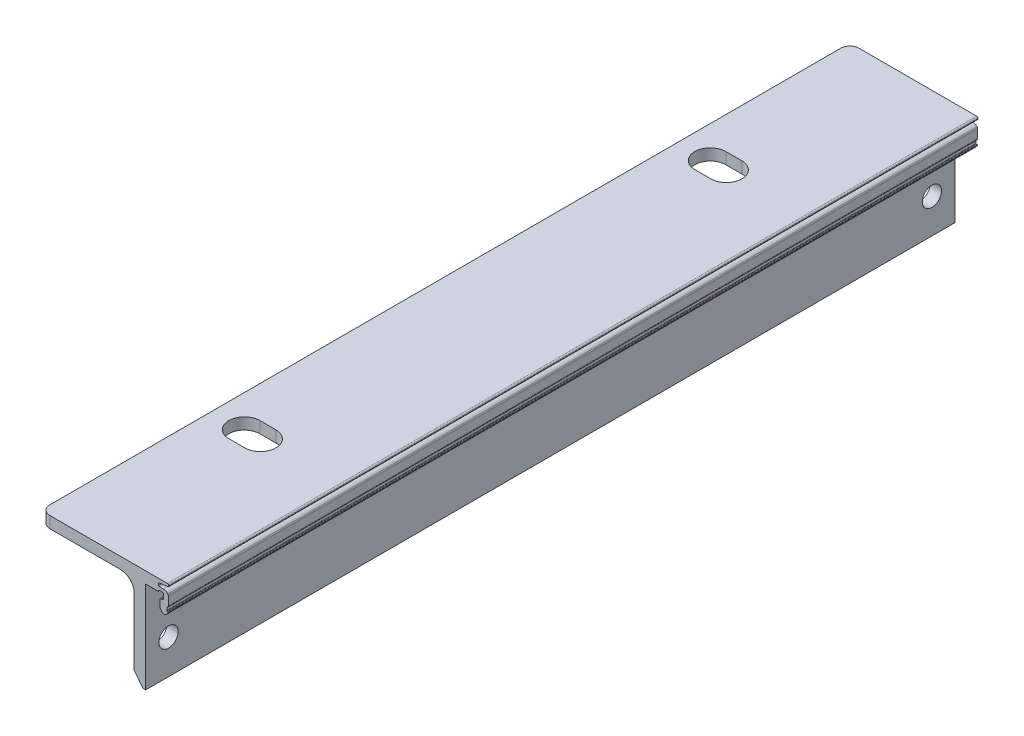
ISO-10303-21;
HEADER;
FILE_DESCRIPTION(('STEP AP214'),'2;1');
FILE_NAME('part.step','',(''),(''),'','','');
FILE_SCHEMA(('AUTOMOTIVE_DESIGN { 1 0 10303 214 1 1 1 1 }'));
ENDSEC;
DATA;
#1=APPLICATION_CONTEXT('core data for automotive mechanical design processes');
#2=APPLICATION_PROTOCOL_DEFINITION('international standard','automotive_design',2000,#1);
#3=PRODUCT_CONTEXT('',#1,'mechanical');
#4=PRODUCT('Part','Part','',(#3));
#5=PRODUCT_RELATED_PRODUCT_CATEGORY('part','',(#4));
#6=PRODUCT_DEFINITION_FORMATION('','',#4);
#7=PRODUCT_DEFINITION_CONTEXT('part definition',#1,'design');
#8=PRODUCT_DEFINITION('design','',#6,#7);
#9=PRODUCT_DEFINITION_SHAPE('','',#8);
#10=(LENGTH_UNIT() NAMED_UNIT(*) SI_UNIT(.MILLI.,.METRE.));
#11=(NAMED_UNIT(*) PLANE_ANGLE_UNIT() SI_UNIT($,.RADIAN.));
#12=(NAMED_UNIT(*) SI_UNIT($,.STERADIAN.) SOLID_ANGLE_UNIT());
#13=UNCERTAINTY_MEASURE_WITH_UNIT(LENGTH_MEASURE(1.E-05),#10,'distance_accuracy_value','');
#14=(GEOMETRIC_REPRESENTATION_CONTEXT(3) GLOBAL_UNCERTAINTY_ASSIGNED_CONTEXT((#13)) GLOBAL_UNIT_ASSIGNED_CONTEXT((#10,
#11,#12)) REPRESENTATION_CONTEXT('',''));
#15=CARTESIAN_POINT('',(0.,0.,0.));
#16=DIRECTION('',(0.,0.,1.));
#17=DIRECTION('',(1.,0.,0.));
#18=AXIS2_PLACEMENT_3D('',#15,#16,#17);
#19=CARTESIAN_POINT('',(2329.98403514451,-3290.10376988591,88.225));
#20=DIRECTION('',(0.,-1.,0.));
#21=DIRECTION('',(1.,0.,0.));
#22=AXIS2_PLACEMENT_3D('',#19,#20,#21);
#23=PLANE('',#22);
#24=DIRECTION('',(-1.,0.,0.));
#25=VECTOR('',#24,1.);
#26=CARTESIAN_POINT('',(2340.4840351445,-3290.10376988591,47.4000000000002));
#27=LINE('',#26,#25);
#28=CARTESIAN_POINT('',(2340.4840351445,-3290.10376988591,47.4000000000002));
#29=VERTEX_POINT('',#28);
#30=CARTESIAN_POINT('',(2336.9840351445,-3290.10376988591,47.4000000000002));
#31=VERTEX_POINT('',#30);
#32=EDGE_CURVE('E379',#29,#31,#27,.T.);
#33=ORIENTED_EDGE('',*,*,#32,.F.);
#34=CARTESIAN_POINT('',(2340.4840351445,-3290.10376988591,50.8));
#35=DIRECTION('',(0.,1.,0.));
#36=DIRECTION('',(1.,0.,0.));
#37=AXIS2_PLACEMENT_3D('',#34,#35,#36);
#38=CIRCLE('',#37,3.39999999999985);
#39=CARTESIAN_POINT('',(2340.4840351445,-3290.10376988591,54.1999999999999));
#40=VERTEX_POINT('',#39);
#41=EDGE_CURVE('E384',#40,#29,#38,.T.);
#42=ORIENTED_EDGE('',*,*,#41,.F.);
#43=DIRECTION('',(1.,0.,0.));
#44=VECTOR('',#43,1.);
#45=CARTESIAN_POINT('',(2340.4840351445,-3290.10376988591,54.1999999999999));
#46=LINE('',#45,#44);
#47=CARTESIAN_POINT('',(2336.9840351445,-3290.10376988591,54.1999999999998));
#48=VERTEX_POINT('',#47);
#49=EDGE_CURVE('E388',#48,#40,#46,.T.);
#50=ORIENTED_EDGE('',*,*,#49,.F.);
#51=CARTESIAN_POINT('',(2336.9840351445,-3290.10376988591,50.8));
#52=DIRECTION('',(0.,1.,0.));
#53=DIRECTION('',(1.,0.,0.));
#54=AXIS2_PLACEMENT_3D('',#51,#52,#53);
#55=CIRCLE('',#54,3.39999999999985);
#56=EDGE_CURVE('E368',#31,#48,#55,.T.);
#57=ORIENTED_EDGE('',*,*,#56,.F.);
#58=EDGE_LOOP('',(#33,#42,#50,#57));
#59=FACE_BOUND('',#58,.T.);
#60=DIRECTION('',(1.,0.,0.));
#61=VECTOR('',#60,1.);
#62=CARTESIAN_POINT('',(2340.4840351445,-3290.10376988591,-47.4000000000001));
#63=LINE('',#62,#61);
#64=CARTESIAN_POINT('',(2336.9840351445,-3290.10376988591,-47.4000000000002));
#65=VERTEX_POINT('',#64);
#66=CARTESIAN_POINT('',(2340.4840351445,-3290.10376988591,-47.4000000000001));
#67=VERTEX_POINT('',#66);
#68=EDGE_CURVE('E399',#65,#67,#63,.T.);
#69=ORIENTED_EDGE('',*,*,#68,.F.);
#70=CARTESIAN_POINT('',(2336.9840351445,-3290.10376988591,-50.8));
#71=DIRECTION('',(0.,1.,0.));
#72=DIRECTION('',(-1.,0.,0.));
#73=AXIS2_PLACEMENT_3D('',#70,#71,#72);
#74=CIRCLE('',#73,3.39999999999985);
#75=CARTESIAN_POINT('',(2336.9840351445,-3290.10376988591,-54.1999999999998));
#76=VERTEX_POINT('',#75);
#77=EDGE_CURVE('E395',#76,#65,#74,.T.);
#78=ORIENTED_EDGE('',*,*,#77,.F.);
#79=DIRECTION('',(-1.,0.,0.));
#80=VECTOR('',#79,1.);
#81=CARTESIAN_POINT('',(2340.4840351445,-3290.10376988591,-54.1999999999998));
#82=LINE('',#81,#80);
#83=CARTESIAN_POINT('',(2340.4840351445,-3290.10376988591,-54.1999999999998));
#84=VERTEX_POINT('',#83);
#85=EDGE_CURVE('E405',#84,#76,#82,.T.);
#86=ORIENTED_EDGE('',*,*,#85,.F.);
#87=CARTESIAN_POINT('',(2340.4840351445,-3290.10376988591,-50.8));
#88=DIRECTION('',(0.,1.,0.));
#89=DIRECTION('',(-1.,0.,0.));
#90=AXIS2_PLACEMENT_3D('',#87,#88,#89);
#91=CIRCLE('',#90,3.39999999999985);
#92=EDGE_CURVE('E402',#67,#84,#91,.T.);
#93=ORIENTED_EDGE('',*,*,#92,.F.);
#94=EDGE_LOOP('',(#69,#78,#86,#93));
#95=FACE_BOUND('',#94,.T.);
#96=DIRECTION('',(-1.,0.,0.));
#97=VECTOR('',#96,1.);
#98=CARTESIAN_POINT('',(2329.98403514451,-3290.10376988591,-88.225));
#99=LINE('',#98,#97);
#100=CARTESIAN_POINT('',(2357.62403514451,-3290.10376988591,-88.225));
#101=VERTEX_POINT('',#100);
#102=CARTESIAN_POINT('',(2331.98403514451,-3290.10376988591,-88.225));
#103=VERTEX_POINT('',#102);
#104=EDGE_CURVE('E411',#101,#103,#99,.T.);
#105=ORIENTED_EDGE('',*,*,#104,.T.);
#106=CARTESIAN_POINT('',(2331.98403514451,-3290.10376988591,-86.225));
#107=DIRECTION('',(0.,-1.,0.));
#108=DIRECTION('',(1.,0.,0.));
#109=AXIS2_PLACEMENT_3D('',#106,#107,#108);
#110=CIRCLE('',#109,2.);
#111=CARTESIAN_POINT('',(2329.98403514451,-3290.10376988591,-86.225));
#112=VERTEX_POINT('',#111);
#113=EDGE_CURVE('E45',#103,#112,#110,.F.);
#114=ORIENTED_EDGE('',*,*,#113,.T.);
#115=DIRECTION('',(0.,0.,-1.));
#116=VECTOR('',#115,1.);
#117=CARTESIAN_POINT('',(2329.98403514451,-3290.10376988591,88.225));
#118=LINE('',#117,#116);
#119=CARTESIAN_POINT('',(2329.98403514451,-3290.10376988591,86.225));
#120=VERTEX_POINT('',#119);
#121=EDGE_CURVE('E689',#120,#112,#118,.T.);
#122=ORIENTED_EDGE('',*,*,#121,.F.);
#123=CARTESIAN_POINT('',(2331.98403514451,-3290.10376988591,86.225));
#124=DIRECTION('',(0.,-1.,0.));
#125=DIRECTION('',(1.,0.,0.));
#126=AXIS2_PLACEMENT_3D('',#123,#124,#125);
#127=CIRCLE('',#126,2.);
#128=CARTESIAN_POINT('',(2331.98403514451,-3290.10376988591,88.225));
#129=VERTEX_POINT('',#128);
#130=EDGE_CURVE('E52',#120,#129,#127,.F.);
#131=ORIENTED_EDGE('',*,*,#130,.T.);
#132=DIRECTION('',(-1.,0.,0.));
#133=VECTOR('',#132,1.);
#134=CARTESIAN_POINT('',(2355.38403514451,-3290.10376988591,88.225));
#135=LINE('',#134,#133);
#136=CARTESIAN_POINT('',(2357.62403514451,-3290.10376988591,88.225));
#137=VERTEX_POINT('',#136);
#138=EDGE_CURVE('E418',#137,#129,#135,.T.);
#139=ORIENTED_EDGE('',*,*,#138,.F.);
#140=DIRECTION('',(0.,0.,-1.));
#141=VECTOR('',#140,1.);
#142=CARTESIAN_POINT('',(2357.62403514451,-3290.10376988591,88.225));
#143=LINE('',#142,#141);
#144=EDGE_CURVE('E497',#137,#101,#143,.T.);
#145=ORIENTED_EDGE('',*,*,#144,.T.);
#146=EDGE_LOOP('',(#105,#114,#122,#131,#139,#145));
#147=FACE_BOUND('',#146,.T.);
#148=ADVANCED_FACE('F37',(#59,#95,#147),#23,.F.);
#149=CARTESIAN_POINT('',(2329.98403514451,-3290.10376988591,88.225));
#150=DIRECTION('',(1.,0.,0.));
#151=DIRECTION('',(0.,0.,-1.));
#152=AXIS2_PLACEMENT_3D('',#149,#150,#151);
#153=PLANE('',#152);
#154=ORIENTED_EDGE('',*,*,#121,.T.);
#155=DIRECTION('',(0.,-1.,0.));
#156=VECTOR('',#155,1.);
#157=CARTESIAN_POINT('',(2329.98403514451,-3292.60376988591,-86.225));
#158=LINE('',#157,#156);
#159=CARTESIAN_POINT('',(2329.98403514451,-3292.60376988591,-86.225));
#160=VERTEX_POINT('',#159);
#161=EDGE_CURVE('E734',#112,#160,#158,.T.);
#162=ORIENTED_EDGE('',*,*,#161,.T.);
#163=DIRECTION('',(0.,0.,-1.));
#164=VECTOR('',#163,1.);
#165=CARTESIAN_POINT('',(2329.98403514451,-3292.60376988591,88.225));
#166=LINE('',#165,#164);
#167=CARTESIAN_POINT('',(2329.98403514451,-3292.60376988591,86.225));
#168=VERTEX_POINT('',#167);
#169=EDGE_CURVE('E686',#168,#160,#166,.T.);
#170=ORIENTED_EDGE('',*,*,#169,.F.);
#171=DIRECTION('',(0.,-1.,0.));
#172=VECTOR('',#171,1.);
#173=CARTESIAN_POINT('',(2329.98403514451,-3290.10376988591,86.225));
#174=LINE('',#173,#172);
#175=EDGE_CURVE('E724',#168,#120,#174,.F.);
#176=ORIENTED_EDGE('',*,*,#175,.T.);
#177=EDGE_LOOP('',(#154,#162,#170,#176));
#178=FACE_BOUND('',#177,.T.);
#179=ADVANCED_FACE('F746',(#178),#153,.F.);
#180=CARTESIAN_POINT('',(2329.98403514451,-3292.60376988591,88.225));
#181=DIRECTION('',(0.,1.,0.));
#182=DIRECTION('',(0.,0.,1.));
#183=AXIS2_PLACEMENT_3D('',#180,#181,#182);
#184=PLANE('',#183);
#185=DIRECTION('',(1.,0.,0.));
#186=VECTOR('',#185,1.);
#187=CARTESIAN_POINT('',(2329.98403514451,-3292.60376988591,54.1999999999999));
#188=LINE('',#187,#186);
#189=CARTESIAN_POINT('',(2336.9840351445,-3292.60376988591,54.1999999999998));
#190=VERTEX_POINT('',#189);
#191=CARTESIAN_POINT('',(2340.4840351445,-3292.60376988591,54.1999999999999));
#192=VERTEX_POINT('',#191);
#193=EDGE_CURVE('E718',#190,#192,#188,.T.);
#194=ORIENTED_EDGE('',*,*,#193,.T.);
#195=CARTESIAN_POINT('',(2340.4840351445,-3292.60376988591,50.8));
#196=DIRECTION('',(0.,1.,0.));
#197=DIRECTION('',(0.,0.,1.));
#198=AXIS2_PLACEMENT_3D('',#195,#196,#197);
#199=CIRCLE('',#198,3.39999999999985);
#200=CARTESIAN_POINT('',(2340.4840351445,-3292.60376988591,47.4000000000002));
#201=VERTEX_POINT('',#200);
#202=EDGE_CURVE('E721',#192,#201,#199,.T.);
#203=ORIENTED_EDGE('',*,*,#202,.T.);
#204=DIRECTION('',(-1.,0.,0.));
#205=VECTOR('',#204,1.);
#206=CARTESIAN_POINT('',(2329.98403514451,-3292.60376988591,47.4000000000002));
#207=LINE('',#206,#205);
#208=CARTESIAN_POINT('',(2336.9840351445,-3292.60376988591,47.4000000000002));
#209=VERTEX_POINT('',#208);
#210=EDGE_CURVE('E715',#201,#209,#207,.T.);
#211=ORIENTED_EDGE('',*,*,#210,.T.);
#212=CARTESIAN_POINT('',(2336.9840351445,-3292.60376988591,50.8));
#213=DIRECTION('',(0.,1.,0.));
#214=DIRECTION('',(0.,0.,1.));
#215=AXIS2_PLACEMENT_3D('',#212,#213,#214);
#216=CIRCLE('',#215,3.39999999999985);
#217=EDGE_CURVE('E371',#209,#190,#216,.T.);
#218=ORIENTED_EDGE('',*,*,#217,.T.);
#219=EDGE_LOOP('',(#194,#203,#211,#218));
#220=FACE_BOUND('',#219,.T.);
#221=DIRECTION('',(-1.,0.,0.));
#222=VECTOR('',#221,1.);
#223=CARTESIAN_POINT('',(2329.98403514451,-3292.60376988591,-54.1999999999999));
#224=LINE('',#223,#222);
#225=CARTESIAN_POINT('',(2340.4840351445,-3292.60376988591,-54.1999999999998));
#226=VERTEX_POINT('',#225);
#227=CARTESIAN_POINT('',(2336.9840351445,-3292.60376988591,-54.1999999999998));
#228=VERTEX_POINT('',#227);
#229=EDGE_CURVE('E709',#226,#228,#224,.T.);
#230=ORIENTED_EDGE('',*,*,#229,.T.);
#231=CARTESIAN_POINT('',(2336.9840351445,-3292.60376988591,-50.8));
#232=DIRECTION('',(0.,1.,0.));
#233=DIRECTION('',(0.,0.,1.));
#234=AXIS2_PLACEMENT_3D('',#231,#232,#233);
#235=CIRCLE('',#234,3.39999999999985);
#236=CARTESIAN_POINT('',(2336.9840351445,-3292.60376988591,-47.4000000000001));
#237=VERTEX_POINT('',#236);
#238=EDGE_CURVE('E712',#228,#237,#235,.T.);
#239=ORIENTED_EDGE('',*,*,#238,.T.);
#240=DIRECTION('',(1.,0.,0.));
#241=VECTOR('',#240,1.);
#242=CARTESIAN_POINT('',(2329.98403514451,-3292.60376988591,-47.4000000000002));
#243=LINE('',#242,#241);
#244=CARTESIAN_POINT('',(2340.4840351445,-3292.60376988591,-47.4000000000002));
#245=VERTEX_POINT('',#244);
#246=EDGE_CURVE('E703',#237,#245,#243,.T.);
#247=ORIENTED_EDGE('',*,*,#246,.T.);
#248=CARTESIAN_POINT('',(2340.4840351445,-3292.60376988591,-50.8));
#249=DIRECTION('',(0.,1.,0.));
#250=DIRECTION('',(0.,0.,1.));
#251=AXIS2_PLACEMENT_3D('',#248,#249,#250);
#252=CIRCLE('',#251,3.39999999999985);
#253=EDGE_CURVE('E706',#245,#226,#252,.T.);
#254=ORIENTED_EDGE('',*,*,#253,.T.);
#255=EDGE_LOOP('',(#230,#239,#247,#254));
#256=FACE_BOUND('',#255,.T.);
#257=ORIENTED_EDGE('',*,*,#169,.T.);
#258=CARTESIAN_POINT('',(2331.98403514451,-3292.60376988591,-86.225));
#259=DIRECTION('',(0.,1.,0.));
#260=DIRECTION('',(0.,0.,1.));
#261=AXIS2_PLACEMENT_3D('',#258,#259,#260);
#262=CIRCLE('',#261,2.);
#263=CARTESIAN_POINT('',(2331.98403514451,-3292.60376988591,-88.225));
#264=VERTEX_POINT('',#263);
#265=EDGE_CURVE('E739',#160,#264,#262,.F.);
#266=ORIENTED_EDGE('',*,*,#265,.T.);
#267=DIRECTION('',(1.,0.,0.));
#268=VECTOR('',#267,1.);
#269=CARTESIAN_POINT('',(2329.98403514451,-3292.60376988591,-88.225));
#270=LINE('',#269,#268);
#271=CARTESIAN_POINT('',(2347.3840351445,-3292.60376988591,-88.225));
#272=VERTEX_POINT('',#271);
#273=EDGE_CURVE('E499',#264,#272,#270,.T.);
#274=ORIENTED_EDGE('',*,*,#273,.T.);
#275=DIRECTION('',(0.,0.,-1.));
#276=VECTOR('',#275,1.);
#277=CARTESIAN_POINT('',(2347.3840351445,-3292.60376988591,88.225));
#278=LINE('',#277,#276);
#279=CARTESIAN_POINT('',(2347.3840351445,-3292.60376988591,88.225));
#280=VERTEX_POINT('',#279);
#281=EDGE_CURVE('E695',#272,#280,#278,.F.);
#282=ORIENTED_EDGE('',*,*,#281,.T.);
#283=DIRECTION('',(1.,0.,0.));
#284=VECTOR('',#283,1.);
#285=CARTESIAN_POINT('',(2329.98403514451,-3292.60376988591,88.225));
#286=LINE('',#285,#284);
#287=CARTESIAN_POINT('',(2331.98403514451,-3292.60376988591,88.225));
#288=VERTEX_POINT('',#287);
#289=EDGE_CURVE('E420',#288,#280,#286,.T.);
#290=ORIENTED_EDGE('',*,*,#289,.F.);
#291=CARTESIAN_POINT('',(2331.98403514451,-3292.60376988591,86.225));
#292=DIRECTION('',(0.,1.,0.));
#293=DIRECTION('',(0.,0.,1.));
#294=AXIS2_PLACEMENT_3D('',#291,#292,#293);
#295=CIRCLE('',#294,2.);
#296=EDGE_CURVE('E737',#288,#168,#295,.F.);
#297=ORIENTED_EDGE('',*,*,#296,.T.);
#298=EDGE_LOOP('',(#257,#266,#274,#282,#290,#297));
#299=FACE_BOUND('',#298,.T.);
#300=ADVANCED_FACE('F751',(#220,#256,#299),#184,.F.);
#301=CARTESIAN_POINT('',(2350.3840351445,-3292.60376988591,88.225));
#302=DIRECTION('',(1.,0.,0.));
#303=DIRECTION('',(0.,0.,-1.));
#304=AXIS2_PLACEMENT_3D('',#301,#302,#303);
#305=PLANE('',#304);
#306=CARTESIAN_POINT('',(2350.38403514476,-3305.10376988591,83.225));
#307=DIRECTION('',(-1.,0.,0.));
#308=DIRECTION('',(0.,1.,0.));
#309=AXIS2_PLACEMENT_3D('',#306,#307,#308);
#310=CIRCLE('',#309,2.09999999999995);
#311=CARTESIAN_POINT('',(2350.38403514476,-3303.00376988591,83.225));
#312=VERTEX_POINT('',#311);
#313=EDGE_CURVE('E732',#312,#312,#310,.T.);
#314=ORIENTED_EDGE('',*,*,#313,.F.);
#315=EDGE_LOOP('',(#314));
#316=FACE_BOUND('',#315,.T.);
#317=CARTESIAN_POINT('',(2350.38403514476,-3305.10376988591,-83.225));
#318=DIRECTION('',(-1.,0.,0.));
#319=DIRECTION('',(0.,-1.,0.));
#320=AXIS2_PLACEMENT_3D('',#317,#318,#319);
#321=CIRCLE('',#320,2.09999999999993);
#322=CARTESIAN_POINT('',(2350.38403514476,-3307.20376988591,-83.225));
#323=VERTEX_POINT('',#322);
#324=EDGE_CURVE('E728',#323,#323,#321,.T.);
#325=ORIENTED_EDGE('',*,*,#324,.F.);
#326=EDGE_LOOP('',(#325));
#327=FACE_BOUND('',#326,.T.);
#328=DIRECTION('',(0.,-1.,0.));
#329=VECTOR('',#328,1.);
#330=CARTESIAN_POINT('',(2350.3840351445,-3292.60376988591,88.225));
#331=LINE('',#330,#329);
#332=CARTESIAN_POINT('',(2350.3840351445,-3295.60376988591,88.225));
#333=VERTEX_POINT('',#332);
#334=CARTESIAN_POINT('',(2350.3840351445,-3310.10376988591,88.225));
#335=VERTEX_POINT('',#334);
#336=EDGE_CURVE('E423',#333,#335,#331,.T.);
#337=ORIENTED_EDGE('',*,*,#336,.F.);
#338=DIRECTION('',(0.,0.,-1.));
#339=VECTOR('',#338,1.);
#340=CARTESIAN_POINT('',(2350.3840351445,-3295.60376988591,-88.225));
#341=LINE('',#340,#339);
#342=CARTESIAN_POINT('',(2350.3840351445,-3295.60376988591,-88.225));
#343=VERTEX_POINT('',#342);
#344=EDGE_CURVE('E692',#333,#343,#341,.T.);
#345=ORIENTED_EDGE('',*,*,#344,.T.);
#346=DIRECTION('',(0.,-1.,0.));
#347=VECTOR('',#346,1.);
#348=CARTESIAN_POINT('',(2350.3840351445,-3292.60376988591,-88.225));
#349=LINE('',#348,#347);
#350=CARTESIAN_POINT('',(2350.3840351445,-3310.10376988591,-88.225));
#351=VERTEX_POINT('',#350);
#352=EDGE_CURVE('E501',#343,#351,#349,.T.);
#353=ORIENTED_EDGE('',*,*,#352,.T.);
#354=DIRECTION('',(0.,0.,-1.));
#355=VECTOR('',#354,1.);
#356=CARTESIAN_POINT('',(2350.3840351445,-3310.10376988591,88.225));
#357=LINE('',#356,#355);
#358=EDGE_CURVE('E683',#335,#351,#357,.T.);
#359=ORIENTED_EDGE('',*,*,#358,.F.);
#360=EDGE_LOOP('',(#337,#345,#353,#359));
#361=FACE_BOUND('',#360,.T.);
#362=ADVANCED_FACE('F937',(#316,#327,#361),#305,.F.);
#363=CARTESIAN_POINT('',(2350.3840351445,-3310.10376988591,88.225));
#364=DIRECTION('',(0.796162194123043,0.605083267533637,0.));
#365=DIRECTION('',(-0.605083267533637,0.796162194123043,0.));
#366=AXIS2_PLACEMENT_3D('',#363,#364,#365);
#367=PLANE('',#366);
#368=DIRECTION('',(0.605083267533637,-0.796162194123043,0.));
#369=VECTOR('',#368,1.);
#370=CARTESIAN_POINT('',(2350.3840351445,-3310.10376988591,-88.225));
#371=LINE('',#370,#369);
#372=CARTESIAN_POINT('',(2352.2840351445,-3312.60376988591,-88.225));
#373=VERTEX_POINT('',#372);
#374=EDGE_CURVE('E503',#351,#373,#371,.T.);
#375=ORIENTED_EDGE('',*,*,#374,.T.);
#376=DIRECTION('',(0.,0.,-1.));
#377=VECTOR('',#376,1.);
#378=CARTESIAN_POINT('',(2352.2840351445,-3312.60376988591,88.225));
#379=LINE('',#378,#377);
#380=CARTESIAN_POINT('',(2352.2840351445,-3312.60376988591,88.225));
#381=VERTEX_POINT('',#380);
#382=EDGE_CURVE('E680',#381,#373,#379,.T.);
#383=ORIENTED_EDGE('',*,*,#382,.F.);
#384=DIRECTION('',(0.605083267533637,-0.796162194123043,0.));
#385=VECTOR('',#384,1.);
#386=CARTESIAN_POINT('',(2350.3840351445,-3310.10376988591,88.225));
#387=LINE('',#386,#385);
#388=EDGE_CURVE('E425',#335,#381,#387,.T.);
#389=ORIENTED_EDGE('',*,*,#388,.F.);
#390=ORIENTED_EDGE('',*,*,#358,.T.);
#391=EDGE_LOOP('',(#375,#383,#389,#390));
#392=FACE_BOUND('',#391,.T.);
#393=ADVANCED_FACE('F933',(#392),#367,.F.);
#394=CARTESIAN_POINT('',(2352.8840351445,-3312.60376988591,88.225));
#395=DIRECTION('',(0.,1.,0.));
#396=DIRECTION('',(0.,0.,1.));
#397=AXIS2_PLACEMENT_3D('',#394,#395,#396);
#398=PLANE('',#397);
#399=DIRECTION('',(1.,0.,0.));
#400=VECTOR('',#399,1.);
#401=CARTESIAN_POINT('',(2352.8840351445,-3312.60376988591,-88.225));
#402=LINE('',#401,#400);
#403=CARTESIAN_POINT('',(2352.8840351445,-3312.60376988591,-88.225));
#404=VERTEX_POINT('',#403);
#405=EDGE_CURVE('E505',#373,#404,#402,.T.);
#406=ORIENTED_EDGE('',*,*,#405,.T.);
#407=DIRECTION('',(0.,0.,-1.));
#408=VECTOR('',#407,1.);
#409=CARTESIAN_POINT('',(2352.8840351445,-3312.60376988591,88.225));
#410=LINE('',#409,#408);
#411=CARTESIAN_POINT('',(2352.8840351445,-3312.60376988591,88.225));
#412=VERTEX_POINT('',#411);
#413=EDGE_CURVE('E677',#412,#404,#410,.T.);
#414=ORIENTED_EDGE('',*,*,#413,.F.);
#415=DIRECTION('',(1.,0.,0.));
#416=VECTOR('',#415,1.);
#417=CARTESIAN_POINT('',(2352.8840351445,-3312.60376988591,88.225));
#418=LINE('',#417,#416);
#419=EDGE_CURVE('E427',#381,#412,#418,.T.);
#420=ORIENTED_EDGE('',*,*,#419,.F.);
#421=ORIENTED_EDGE('',*,*,#382,.T.);
#422=EDGE_LOOP('',(#406,#414,#420,#421));
#423=FACE_BOUND('',#422,.T.);
#424=ADVANCED_FACE('F929',(#423),#398,.F.);
#425=CARTESIAN_POINT('',(2352.88403514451,-3292.60376988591,88.225));
#426=DIRECTION('',(-1.,0.,0.));
#427=DIRECTION('',(0.,-1.,0.));
#428=AXIS2_PLACEMENT_3D('',#425,#426,#427);
#429=PLANE('',#428);
#430=CARTESIAN_POINT('',(2352.88403514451,-3305.10376988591,83.225));
#431=DIRECTION('',(-1.,0.,0.));
#432=DIRECTION('',(0.,-1.,0.));
#433=AXIS2_PLACEMENT_3D('',#430,#431,#432);
#434=CIRCLE('',#433,2.09999999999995);
#435=CARTESIAN_POINT('',(2352.88403514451,-3307.20376988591,83.225));
#436=VERTEX_POINT('',#435);
#437=EDGE_CURVE('E729',#436,#436,#434,.T.);
#438=ORIENTED_EDGE('',*,*,#437,.T.);
#439=EDGE_LOOP('',(#438));
#440=FACE_BOUND('',#439,.T.);
#441=CARTESIAN_POINT('',(2352.88403514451,-3305.10376988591,-83.225));
#442=DIRECTION('',(-1.,0.,0.));
#443=DIRECTION('',(0.,-1.,0.));
#444=AXIS2_PLACEMENT_3D('',#441,#442,#443);
#445=CIRCLE('',#444,2.09999999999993);
#446=CARTESIAN_POINT('',(2352.88403514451,-3307.20376988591,-83.225));
#447=VERTEX_POINT('',#446);
#448=EDGE_CURVE('E725',#447,#447,#445,.T.);
#449=ORIENTED_EDGE('',*,*,#448,.T.);
#450=EDGE_LOOP('',(#449));
#451=FACE_BOUND('',#450,.T.);
#452=DIRECTION('',(0.,1.,0.));
#453=VECTOR('',#452,1.);
#454=CARTESIAN_POINT('',(2352.88403514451,-3292.60376988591,-88.225));
#455=LINE('',#454,#453);
#456=CARTESIAN_POINT('',(2352.88403514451,-3292.60376988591,-88.225));
#457=VERTEX_POINT('',#456);
#458=EDGE_CURVE('E507',#404,#457,#455,.T.);
#459=ORIENTED_EDGE('',*,*,#458,.T.);
#460=DIRECTION('',(0.,0.,-1.));
#461=VECTOR('',#460,1.);
#462=CARTESIAN_POINT('',(2352.88403514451,-3292.60376988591,88.225));
#463=LINE('',#462,#461);
#464=CARTESIAN_POINT('',(2352.88403514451,-3292.60376988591,88.225));
#465=VERTEX_POINT('',#464);
#466=EDGE_CURVE('E674',#465,#457,#463,.T.);
#467=ORIENTED_EDGE('',*,*,#466,.F.);
#468=DIRECTION('',(0.,1.,0.));
#469=VECTOR('',#468,1.);
#470=CARTESIAN_POINT('',(2352.88403514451,-3292.60376988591,88.225));
#471=LINE('',#470,#469);
#472=EDGE_CURVE('E429',#412,#465,#471,.T.);
#473=ORIENTED_EDGE('',*,*,#472,.F.);
#474=ORIENTED_EDGE('',*,*,#413,.T.);
#475=EDGE_LOOP('',(#459,#467,#473,#474));
#476=FACE_BOUND('',#475,.T.);
#477=ADVANCED_FACE('F925',(#440,#451,#476),#429,.F.);
#478=CARTESIAN_POINT('',(2355.38403514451,-3292.60376988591,88.225));
#479=DIRECTION('',(0.,1.,0.));
#480=DIRECTION('',(0.,0.,1.));
#481=AXIS2_PLACEMENT_3D('',#478,#479,#480);
#482=PLANE('',#481);
#483=DIRECTION('',(1.,0.,0.));
#484=VECTOR('',#483,1.);
#485=CARTESIAN_POINT('',(2355.38403514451,-3292.60376988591,-88.225));
#486=LINE('',#485,#484);
#487=CARTESIAN_POINT('',(2355.46834905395,-3292.60376988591,-88.225));
#488=VERTEX_POINT('',#487);
#489=EDGE_CURVE('E510',#457,#488,#486,.T.);
#490=ORIENTED_EDGE('',*,*,#489,.T.);
#491=DIRECTION('',(0.,0.,-1.));
#492=VECTOR('',#491,1.);
#493=CARTESIAN_POINT('',(2355.46834905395,-3292.60376988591,88.225));
#494=LINE('',#493,#492);
#495=CARTESIAN_POINT('',(2355.46834905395,-3292.60376988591,88.225));
#496=VERTEX_POINT('',#495);
#497=EDGE_CURVE('E671',#496,#488,#494,.T.);
#498=ORIENTED_EDGE('',*,*,#497,.F.);
#499=DIRECTION('',(1.,-3.55271367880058E-13,0.));
#500=VECTOR('',#499,1.);
#501=CARTESIAN_POINT('',(2352.88403514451,-3292.60376988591,88.225));
#502=LINE('',#501,#500);
#503=EDGE_CURVE('E431',#465,#496,#502,.T.);
#504=ORIENTED_EDGE('',*,*,#503,.F.);
#505=ORIENTED_EDGE('',*,*,#466,.T.);
#506=EDGE_LOOP('',(#490,#498,#504,#505));
#507=FACE_BOUND('',#506,.T.);
#508=ADVANCED_FACE('F921',(#507),#482,.F.);
#509=CARTESIAN_POINT('',(2355.46834905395,-3292.30376988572,88.225));
#510=DIRECTION('',(0.,0.,-1.));
#511=DIRECTION('',(-1.,0.,0.));
#512=AXIS2_PLACEMENT_3D('',#509,#510,#511);
#513=CYLINDRICAL_SURFACE('',#512,0.300000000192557);
#514=CARTESIAN_POINT('',(2355.46834905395,-3292.30376988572,-88.225));
#515=DIRECTION('',(0.,0.,1.));
#516=DIRECTION('',(-1.,0.,0.));
#517=AXIS2_PLACEMENT_3D('',#514,#515,#516);
#518=CIRCLE('',#517,0.300000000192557);
#519=CARTESIAN_POINT('',(2355.72815667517,-3292.45376988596,-88.225));
#520=VERTEX_POINT('',#519);
#521=EDGE_CURVE('E512',#488,#520,#518,.T.);
#522=ORIENTED_EDGE('',*,*,#521,.T.);
#523=DIRECTION('',(0.,0.,-1.));
#524=VECTOR('',#523,1.);
#525=CARTESIAN_POINT('',(2355.72815667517,-3292.45376988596,88.225));
#526=LINE('',#525,#524);
#527=CARTESIAN_POINT('',(2355.72815667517,-3292.45376988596,88.225));
#528=VERTEX_POINT('',#527);
#529=EDGE_CURVE('E668',#528,#520,#526,.T.);
#530=ORIENTED_EDGE('',*,*,#529,.F.);
#531=CARTESIAN_POINT('',(2355.46834905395,-3292.30376988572,88.225));
#532=DIRECTION('',(0.,0.,1.));
#533=DIRECTION('',(-1.,0.,0.));
#534=AXIS2_PLACEMENT_3D('',#531,#532,#533);
#535=CIRCLE('',#534,0.300000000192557);
#536=EDGE_CURVE('E433',#496,#528,#535,.T.);
#537=ORIENTED_EDGE('',*,*,#536,.F.);
#538=ORIENTED_EDGE('',*,*,#497,.T.);
#539=EDGE_LOOP('',(#522,#530,#537,#538));
#540=FACE_BOUND('',#539,.T.);
#541=ADVANCED_FACE('F917',(#540),#513,.T.);
#542=CARTESIAN_POINT('',(2355.9879642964,-3292.60376988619,88.225));
#543=DIRECTION('',(0.,0.,-1.));
#544=DIRECTION('',(-1.,0.,0.));
#545=AXIS2_PLACEMENT_3D('',#542,#543,#544);
#546=CYLINDRICAL_SURFACE('',#545,0.300000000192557);
#547=CARTESIAN_POINT('',(2355.9879642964,-3292.60376988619,-88.225));
#548=DIRECTION('',(0.,0.,-1.));
#549=DIRECTION('',(-1.,0.,0.));
#550=AXIS2_PLACEMENT_3D('',#547,#548,#549);
#551=CIRCLE('',#550,0.300000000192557);
#552=CARTESIAN_POINT('',(2355.9879642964,-3292.303769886,-88.225));
#553=VERTEX_POINT('',#552);
#554=EDGE_CURVE('E514',#520,#553,#551,.T.);
#555=ORIENTED_EDGE('',*,*,#554,.T.);
#556=DIRECTION('',(0.,0.,-1.));
#557=VECTOR('',#556,1.);
#558=CARTESIAN_POINT('',(2355.9879642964,-3292.303769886,88.225));
#559=LINE('',#558,#557);
#560=CARTESIAN_POINT('',(2355.9879642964,-3292.303769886,88.225));
#561=VERTEX_POINT('',#560);
#562=EDGE_CURVE('E665',#561,#553,#559,.T.);
#563=ORIENTED_EDGE('',*,*,#562,.F.);
#564=CARTESIAN_POINT('',(2355.9879642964,-3292.60376988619,88.225));
#565=DIRECTION('',(0.,0.,-1.));
#566=DIRECTION('',(-1.,0.,0.));
#567=AXIS2_PLACEMENT_3D('',#564,#565,#566);
#568=CIRCLE('',#567,0.300000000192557);
#569=EDGE_CURVE('E435',#528,#561,#568,.T.);
#570=ORIENTED_EDGE('',*,*,#569,.F.);
#571=ORIENTED_EDGE('',*,*,#529,.T.);
#572=EDGE_LOOP('',(#555,#563,#570,#571));
#573=FACE_BOUND('',#572,.T.);
#574=ADVANCED_FACE('F913',(#573),#546,.F.);
#575=CARTESIAN_POINT('',(2356.52403514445,-3292.303769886,88.225));
#576=DIRECTION('',(0.,1.,0.));
#577=DIRECTION('',(0.,0.,1.));
#578=AXIS2_PLACEMENT_3D('',#575,#576,#577);
#579=PLANE('',#578);
#580=DIRECTION('',(1.,0.,0.));
#581=VECTOR('',#580,1.);
#582=CARTESIAN_POINT('',(2356.52403514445,-3292.303769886,-88.225));
#583=LINE('',#582,#581);
#584=CARTESIAN_POINT('',(2356.52403514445,-3292.303769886,-88.225));
#585=VERTEX_POINT('',#584);
#586=EDGE_CURVE('E516',#553,#585,#583,.T.);
#587=ORIENTED_EDGE('',*,*,#586,.T.);
#588=DIRECTION('',(0.,0.,-1.));
#589=VECTOR('',#588,1.);
#590=CARTESIAN_POINT('',(2356.52403514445,-3292.303769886,88.225));
#591=LINE('',#590,#589);
#592=CARTESIAN_POINT('',(2356.52403514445,-3292.303769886,88.225));
#593=VERTEX_POINT('',#592);
#594=EDGE_CURVE('E662',#593,#585,#591,.T.);
#595=ORIENTED_EDGE('',*,*,#594,.F.);
#596=DIRECTION('',(1.,0.,0.));
#597=VECTOR('',#596,1.);
#598=CARTESIAN_POINT('',(2356.52403514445,-3292.303769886,88.225));
#599=LINE('',#598,#597);
#600=EDGE_CURVE('E437',#561,#593,#599,.T.);
#601=ORIENTED_EDGE('',*,*,#600,.F.);
#602=ORIENTED_EDGE('',*,*,#562,.T.);
#603=EDGE_LOOP('',(#587,#595,#601,#602));
#604=FACE_BOUND('',#603,.T.);
#605=ADVANCED_FACE('F909',(#604),#579,.F.);
#606=CARTESIAN_POINT('',(2356.52403514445,-3292.603769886,88.225));
#607=DIRECTION('',(0.,0.,-1.));
#608=DIRECTION('',(-1.,0.,0.));
#609=AXIS2_PLACEMENT_3D('',#606,#607,#608);
#610=CYLINDRICAL_SURFACE('',#609,0.300000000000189);
#611=CARTESIAN_POINT('',(2356.52403514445,-3292.603769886,-88.225));
#612=DIRECTION('',(0.,0.,-1.));
#613=DIRECTION('',(-1.,0.,0.));
#614=AXIS2_PLACEMENT_3D('',#611,#612,#613);
#615=CIRCLE('',#614,0.300000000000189);
#616=CARTESIAN_POINT('',(2356.82403514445,-3292.603769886,-88.225));
#617=VERTEX_POINT('',#616);
#618=EDGE_CURVE('E518',#585,#617,#615,.T.);
#619=ORIENTED_EDGE('',*,*,#618,.T.);
#620=DIRECTION('',(0.,0.,-1.));
#621=VECTOR('',#620,1.);
#622=CARTESIAN_POINT('',(2356.82403514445,-3292.603769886,88.225));
#623=LINE('',#622,#621);
#624=CARTESIAN_POINT('',(2356.82403514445,-3292.603769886,88.225));
#625=VERTEX_POINT('',#624);
#626=EDGE_CURVE('E659',#625,#617,#623,.T.);
#627=ORIENTED_EDGE('',*,*,#626,.F.);
#628=CARTESIAN_POINT('',(2356.52403514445,-3292.603769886,88.225));
#629=DIRECTION('',(0.,0.,-1.));
#630=DIRECTION('',(-1.,0.,0.));
#631=AXIS2_PLACEMENT_3D('',#628,#629,#630);
#632=CIRCLE('',#631,0.300000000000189);
#633=EDGE_CURVE('E439',#593,#625,#632,.T.);
#634=ORIENTED_EDGE('',*,*,#633,.F.);
#635=ORIENTED_EDGE('',*,*,#594,.T.);
#636=EDGE_LOOP('',(#619,#627,#634,#635));
#637=FACE_BOUND('',#636,.T.);
#638=ADVANCED_FACE('F905',(#637),#610,.F.);
#639=CARTESIAN_POINT('',(2356.82403514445,-3293.40376988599,88.225));
#640=DIRECTION('',(1.,0.,0.));
#641=DIRECTION('',(0.,0.,-1.));
#642=AXIS2_PLACEMENT_3D('',#639,#640,#641);
#643=PLANE('',#642);
#644=DIRECTION('',(0.,-1.,0.));
#645=VECTOR('',#644,1.);
#646=CARTESIAN_POINT('',(2356.82403514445,-3293.40376988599,-88.225));
#647=LINE('',#646,#645);
#648=CARTESIAN_POINT('',(2356.82403514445,-3293.40376988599,-88.225));
#649=VERTEX_POINT('',#648);
#650=EDGE_CURVE('E520',#617,#649,#647,.T.);
#651=ORIENTED_EDGE('',*,*,#650,.T.);
#652=DIRECTION('',(0.,0.,-1.));
#653=VECTOR('',#652,1.);
#654=CARTESIAN_POINT('',(2356.82403514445,-3293.40376988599,88.225));
#655=LINE('',#654,#653);
#656=CARTESIAN_POINT('',(2356.82403514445,-3293.40376988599,88.225));
#657=VERTEX_POINT('',#656);
#658=EDGE_CURVE('E656',#657,#649,#655,.T.);
#659=ORIENTED_EDGE('',*,*,#658,.F.);
#660=DIRECTION('',(0.,-1.,0.));
#661=VECTOR('',#660,1.);
#662=CARTESIAN_POINT('',(2356.82403514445,-3293.40376988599,88.225));
#663=LINE('',#662,#661);
#664=EDGE_CURVE('E441',#625,#657,#663,.T.);
#665=ORIENTED_EDGE('',*,*,#664,.F.);
#666=ORIENTED_EDGE('',*,*,#626,.T.);
#667=EDGE_LOOP('',(#651,#659,#665,#666));
#668=FACE_BOUND('',#667,.T.);
#669=ADVANCED_FACE('F901',(#668),#643,.F.);
#670=CARTESIAN_POINT('',(2356.52403514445,-3293.40376988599,88.225));
#671=DIRECTION('',(0.,0.,-1.));
#672=DIRECTION('',(-1.,0.,0.));
#673=AXIS2_PLACEMENT_3D('',#670,#671,#672);
#674=CYLINDRICAL_SURFACE('',#673,0.300000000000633);
#675=CARTESIAN_POINT('',(2356.52403514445,-3293.40376988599,-88.225));
#676=DIRECTION('',(0.,0.,-1.));
#677=DIRECTION('',(-1.,0.,0.));
#678=AXIS2_PLACEMENT_3D('',#675,#676,#677);
#679=CIRCLE('',#678,0.300000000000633);
#680=CARTESIAN_POINT('',(2356.52403514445,-3293.70376988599,-88.225));
#681=VERTEX_POINT('',#680);
#682=EDGE_CURVE('E522',#649,#681,#679,.T.);
#683=ORIENTED_EDGE('',*,*,#682,.T.);
#684=DIRECTION('',(0.,0.,-1.));
#685=VECTOR('',#684,1.);
#686=CARTESIAN_POINT('',(2356.52403514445,-3293.70376988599,88.225));
#687=LINE('',#686,#685);
#688=CARTESIAN_POINT('',(2356.52403514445,-3293.70376988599,88.225));
#689=VERTEX_POINT('',#688);
#690=EDGE_CURVE('E653',#689,#681,#687,.T.);
#691=ORIENTED_EDGE('',*,*,#690,.F.);
#692=CARTESIAN_POINT('',(2356.52403514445,-3293.40376988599,88.225));
#693=DIRECTION('',(0.,0.,-1.));
#694=DIRECTION('',(-1.,0.,0.));
#695=AXIS2_PLACEMENT_3D('',#692,#693,#694);
#696=CIRCLE('',#695,0.300000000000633);
#697=EDGE_CURVE('E443',#657,#689,#696,.T.);
#698=ORIENTED_EDGE('',*,*,#697,.F.);
#699=ORIENTED_EDGE('',*,*,#658,.T.);
#700=EDGE_LOOP('',(#683,#691,#698,#699));
#701=FACE_BOUND('',#700,.T.);
#702=ADVANCED_FACE('F897',(#701),#674,.F.);
#703=CARTESIAN_POINT('',(2356.32403514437,-3293.70376988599,88.225));
#704=DIRECTION('',(0.,-1.,0.));
#705=DIRECTION('',(0.,0.,-1.));
#706=AXIS2_PLACEMENT_3D('',#703,#704,#705);
#707=PLANE('',#706);
#708=DIRECTION('',(-1.,0.,0.));
#709=VECTOR('',#708,1.);
#710=CARTESIAN_POINT('',(2356.32403514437,-3293.70376988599,-88.225));
#711=LINE('',#710,#709);
#712=CARTESIAN_POINT('',(2356.32403514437,-3293.70376988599,-88.225));
#713=VERTEX_POINT('',#712);
#714=EDGE_CURVE('E524',#681,#713,#711,.T.);
#715=ORIENTED_EDGE('',*,*,#714,.T.);
#716=DIRECTION('',(0.,0.,-1.));
#717=VECTOR('',#716,1.);
#718=CARTESIAN_POINT('',(2356.32403514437,-3293.70376988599,88.225));
#719=LINE('',#718,#717);
#720=CARTESIAN_POINT('',(2356.32403514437,-3293.70376988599,88.225));
#721=VERTEX_POINT('',#720);
#722=EDGE_CURVE('E650',#721,#713,#719,.T.);
#723=ORIENTED_EDGE('',*,*,#722,.F.);
#724=DIRECTION('',(-1.,0.,0.));
#725=VECTOR('',#724,1.);
#726=CARTESIAN_POINT('',(2356.32403514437,-3293.70376988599,88.225));
#727=LINE('',#726,#725);
#728=EDGE_CURVE('E445',#689,#721,#727,.T.);
#729=ORIENTED_EDGE('',*,*,#728,.F.);
#730=ORIENTED_EDGE('',*,*,#690,.T.);
#731=EDGE_LOOP('',(#715,#723,#729,#730));
#732=FACE_BOUND('',#731,.T.);
#733=ADVANCED_FACE('F893',(#732),#707,.F.);
#734=CARTESIAN_POINT('',(2356.32403514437,-3294.003769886,88.225));
#735=DIRECTION('',(0.,0.,-1.));
#736=DIRECTION('',(-1.,0.,0.));
#737=AXIS2_PLACEMENT_3D('',#734,#735,#736);
#738=CYLINDRICAL_SURFACE('',#737,0.300000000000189);
#739=CARTESIAN_POINT('',(2356.32403514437,-3294.003769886,-88.225));
#740=DIRECTION('',(0.,0.,1.));
#741=DIRECTION('',(-1.,0.,0.));
#742=AXIS2_PLACEMENT_3D('',#739,#740,#741);
#743=CIRCLE('',#742,0.300000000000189);
#744=CARTESIAN_POINT('',(2356.02403514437,-3294.003769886,-88.225));
#745=VERTEX_POINT('',#744);
#746=EDGE_CURVE('E526',#713,#745,#743,.T.);
#747=ORIENTED_EDGE('',*,*,#746,.T.);
#748=DIRECTION('',(0.,0.,-1.));
#749=VECTOR('',#748,1.);
#750=CARTESIAN_POINT('',(2356.02403514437,-3294.003769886,88.225));
#751=LINE('',#750,#749);
#752=CARTESIAN_POINT('',(2356.02403514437,-3294.003769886,88.225));
#753=VERTEX_POINT('',#752);
#754=EDGE_CURVE('E647',#753,#745,#751,.T.);
#755=ORIENTED_EDGE('',*,*,#754,.F.);
#756=CARTESIAN_POINT('',(2356.32403514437,-3294.003769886,88.225));
#757=DIRECTION('',(0.,0.,1.));
#758=DIRECTION('',(-1.,0.,0.));
#759=AXIS2_PLACEMENT_3D('',#756,#757,#758);
#760=CIRCLE('',#759,0.300000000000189);
#761=EDGE_CURVE('E447',#721,#753,#760,.T.);
#762=ORIENTED_EDGE('',*,*,#761,.F.);
#763=ORIENTED_EDGE('',*,*,#722,.T.);
#764=EDGE_LOOP('',(#747,#755,#762,#763));
#765=FACE_BOUND('',#764,.T.);
#766=ADVANCED_FACE('F889',(#765),#738,.T.);
#767=CARTESIAN_POINT('',(2356.02403514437,-3295.45454467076,88.225));
#768=DIRECTION('',(1.,3.06104858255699E-13,0.));
#769=DIRECTION('',(-3.06104858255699E-13,1.,0.));
#770=AXIS2_PLACEMENT_3D('',#767,#768,#769);
#771=PLANE('',#770);
#772=DIRECTION('',(3.06104858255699E-13,-1.,0.));
#773=VECTOR('',#772,1.);
#774=CARTESIAN_POINT('',(2356.02403514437,-3295.45454467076,-88.225));
#775=LINE('',#774,#773);
#776=CARTESIAN_POINT('',(2356.02403514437,-3295.45454467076,-88.225));
#777=VERTEX_POINT('',#776);
#778=EDGE_CURVE('E528',#745,#777,#775,.T.);
#779=ORIENTED_EDGE('',*,*,#778,.T.);
#780=DIRECTION('',(0.,0.,-1.));
#781=VECTOR('',#780,1.);
#782=CARTESIAN_POINT('',(2356.02403514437,-3295.45454467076,88.225));
#783=LINE('',#782,#781);
#784=CARTESIAN_POINT('',(2356.02403514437,-3295.45454467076,88.225));
#785=VERTEX_POINT('',#784);
#786=EDGE_CURVE('E644',#785,#777,#783,.T.);
#787=ORIENTED_EDGE('',*,*,#786,.F.);
#788=DIRECTION('',(3.06104858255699E-13,-1.,0.));
#789=VECTOR('',#788,1.);
#790=CARTESIAN_POINT('',(2356.02403514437,-3295.45454467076,88.225));
#791=LINE('',#790,#789);
#792=EDGE_CURVE('E449',#753,#785,#791,.T.);
#793=ORIENTED_EDGE('',*,*,#792,.F.);
#794=ORIENTED_EDGE('',*,*,#754,.T.);
#795=EDGE_LOOP('',(#779,#787,#793,#794));
#796=FACE_BOUND('',#795,.T.);
#797=ADVANCED_FACE('F885',(#796),#771,.F.);
#798=CARTESIAN_POINT('',(2356.3240351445,-3295.45454467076,88.225));
#799=DIRECTION('',(0.,0.,-1.));
#800=DIRECTION('',(-1.,0.,0.));
#801=AXIS2_PLACEMENT_3D('',#798,#799,#800);
#802=CYLINDRICAL_SURFACE('',#801,0.300000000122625);
#803=CARTESIAN_POINT('',(2356.3240351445,-3295.45454467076,-88.225));
#804=DIRECTION('',(0.,0.,1.));
#805=DIRECTION('',(-1.,0.,0.));
#806=AXIS2_PLACEMENT_3D('',#803,#804,#805);
#807=CIRCLE('',#806,0.300000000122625);
#808=CARTESIAN_POINT('',(2356.09426057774,-3295.64742714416,-88.225));
#809=VERTEX_POINT('',#808);
#810=EDGE_CURVE('E530',#777,#809,#807,.T.);
#811=ORIENTED_EDGE('',*,*,#810,.T.);
#812=DIRECTION('',(0.,0.,-1.));
#813=VECTOR('',#812,1.);
#814=CARTESIAN_POINT('',(2356.09426057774,-3295.64742714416,88.225));
#815=LINE('',#814,#813);
#816=CARTESIAN_POINT('',(2356.09426057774,-3295.64742714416,88.225));
#817=VERTEX_POINT('',#816);
#818=EDGE_CURVE('E641',#817,#809,#815,.T.);
#819=ORIENTED_EDGE('',*,*,#818,.F.);
#820=CARTESIAN_POINT('',(2356.3240351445,-3295.45454467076,88.225));
#821=DIRECTION('',(0.,0.,1.));
#822=DIRECTION('',(-1.,0.,0.));
#823=AXIS2_PLACEMENT_3D('',#820,#821,#822);
#824=CIRCLE('',#823,0.300000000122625);
#825=EDGE_CURVE('E451',#785,#817,#824,.T.);
#826=ORIENTED_EDGE('',*,*,#825,.F.);
#827=ORIENTED_EDGE('',*,*,#786,.T.);
#828=EDGE_LOOP('',(#811,#819,#826,#827));
#829=FACE_BOUND('',#828,.T.);
#830=ADVANCED_FACE('F881',(#829),#802,.T.);
#831=CARTESIAN_POINT('',(2356.46501305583,-3296.08909241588,88.225));
#832=DIRECTION('',(0.765915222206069,0.642941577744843,0.));
#833=DIRECTION('',(-0.642941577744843,0.765915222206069,0.));
#834=AXIS2_PLACEMENT_3D('',#831,#832,#833);
#835=PLANE('',#834);
#836=DIRECTION('',(0.642941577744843,-0.765915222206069,0.));
#837=VECTOR('',#836,1.);
#838=CARTESIAN_POINT('',(2356.46501305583,-3296.08909241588,-88.225));
#839=LINE('',#838,#837);
#840=CARTESIAN_POINT('',(2356.46501305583,-3296.08909241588,-88.225));
#841=VERTEX_POINT('',#840);
#842=EDGE_CURVE('E532',#809,#841,#839,.T.);
#843=ORIENTED_EDGE('',*,*,#842,.T.);
#844=DIRECTION('',(0.,0.,-1.));
#845=VECTOR('',#844,1.);
#846=CARTESIAN_POINT('',(2356.46501305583,-3296.08909241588,88.225));
#847=LINE('',#846,#845);
#848=CARTESIAN_POINT('',(2356.46501305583,-3296.08909241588,88.225));
#849=VERTEX_POINT('',#848);
#850=EDGE_CURVE('E638',#849,#841,#847,.T.);
#851=ORIENTED_EDGE('',*,*,#850,.F.);
#852=DIRECTION('',(0.642941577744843,-0.765915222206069,0.));
#853=VECTOR('',#852,1.);
#854=CARTESIAN_POINT('',(2356.46501305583,-3296.08909241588,88.225));
#855=LINE('',#854,#853);
#856=EDGE_CURVE('E453',#817,#849,#855,.T.);
#857=ORIENTED_EDGE('',*,*,#856,.F.);
#858=ORIENTED_EDGE('',*,*,#818,.T.);
#859=EDGE_LOOP('',(#843,#851,#857,#858));
#860=FACE_BOUND('',#859,.T.);
#861=ADVANCED_FACE('F877',(#860),#835,.F.);
#862=CARTESIAN_POINT('',(2356.92403515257,-3295.703769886,88.225));
#863=DIRECTION('',(0.,0.,-1.));
#864=DIRECTION('',(-1.,0.,0.));
#865=AXIS2_PLACEMENT_3D('',#862,#863,#864);
#866=CYLINDRICAL_SURFACE('',#865,0.599311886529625);
#867=CARTESIAN_POINT('',(2356.92403515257,-3295.703769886,-88.225));
#868=DIRECTION('',(0.,0.,1.));
#869=DIRECTION('',(-1.,0.,0.));
#870=AXIS2_PLACEMENT_3D('',#867,#868,#869);
#871=CIRCLE('',#870,0.599311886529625);
#872=CARTESIAN_POINT('',(2357.38305725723,-3296.08909240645,-88.225));
#873=VERTEX_POINT('',#872);
#874=EDGE_CURVE('E534',#841,#873,#871,.T.);
#875=ORIENTED_EDGE('',*,*,#874,.T.);
#876=DIRECTION('',(0.,0.,-1.));
#877=VECTOR('',#876,1.);
#878=CARTESIAN_POINT('',(2357.38305725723,-3296.08909240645,88.225));
#879=LINE('',#878,#877);
#880=CARTESIAN_POINT('',(2357.38305725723,-3296.08909240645,88.225));
#881=VERTEX_POINT('',#880);
#882=EDGE_CURVE('E635',#881,#873,#879,.T.);
#883=ORIENTED_EDGE('',*,*,#882,.F.);
#884=CARTESIAN_POINT('',(2356.92403515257,-3295.703769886,88.225));
#885=DIRECTION('',(0.,0.,1.));
#886=DIRECTION('',(-1.,0.,0.));
#887=AXIS2_PLACEMENT_3D('',#884,#885,#886);
#888=CIRCLE('',#887,0.599311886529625);
#889=EDGE_CURVE('E455',#849,#881,#888,.T.);
#890=ORIENTED_EDGE('',*,*,#889,.F.);
#891=ORIENTED_EDGE('',*,*,#850,.T.);
#892=EDGE_LOOP('',(#875,#883,#890,#891));
#893=FACE_BOUND('',#892,.T.);
#894=ADVANCED_FACE('F873',(#893),#866,.T.);
#895=CARTESIAN_POINT('',(2357.80062666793,-3295.59165563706,88.225));
#896=DIRECTION('',(-0.765915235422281,0.642941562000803,0.));
#897=DIRECTION('',(-0.642941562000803,-0.765915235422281,0.));
#898=AXIS2_PLACEMENT_3D('',#895,#896,#897);
#899=PLANE('',#898);
#900=DIRECTION('',(0.642941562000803,0.765915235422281,0.));
#901=VECTOR('',#900,1.);
#902=CARTESIAN_POINT('',(2357.80062666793,-3295.59165563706,-88.225));
#903=LINE('',#902,#901);
#904=CARTESIAN_POINT('',(2357.80062666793,-3295.59165563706,-88.225));
#905=VERTEX_POINT('',#904);
#906=EDGE_CURVE('E536',#873,#905,#903,.T.);
#907=ORIENTED_EDGE('',*,*,#906,.T.);
#908=DIRECTION('',(0.,0.,-1.));
#909=VECTOR('',#908,1.);
#910=CARTESIAN_POINT('',(2357.80062666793,-3295.59165563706,88.225));
#911=LINE('',#910,#909);
#912=CARTESIAN_POINT('',(2357.80062666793,-3295.59165563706,88.225));
#913=VERTEX_POINT('',#912);
#914=EDGE_CURVE('E632',#913,#905,#911,.T.);
#915=ORIENTED_EDGE('',*,*,#914,.F.);
#916=DIRECTION('',(0.642941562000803,0.765915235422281,0.));
#917=VECTOR('',#916,1.);
#918=CARTESIAN_POINT('',(2357.80062666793,-3295.59165563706,88.225));
#919=LINE('',#918,#917);
#920=EDGE_CURVE('E457',#881,#913,#919,.T.);
#921=ORIENTED_EDGE('',*,*,#920,.F.);
#922=ORIENTED_EDGE('',*,*,#882,.T.);
#923=EDGE_LOOP('',(#907,#915,#921,#922));
#924=FACE_BOUND('',#923,.T.);
#925=ADVANCED_FACE('F869',(#924),#899,.F.);
#926=CARTESIAN_POINT('',(2357.7240351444,-3295.52736148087,88.225));
#927=DIRECTION('',(0.,0.,-1.));
#928=DIRECTION('',(-1.,0.,0.));
#929=AXIS2_PLACEMENT_3D('',#926,#927,#928);
#930=CYLINDRICAL_SURFACE('',#929,0.0999999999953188);
#931=CARTESIAN_POINT('',(2357.7240351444,-3295.52736148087,-88.225));
#932=DIRECTION('',(0.,0.,1.));
#933=DIRECTION('',(-1.,0.,0.));
#934=AXIS2_PLACEMENT_3D('',#931,#932,#933);
#935=CIRCLE('',#934,0.0999999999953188);
#936=CARTESIAN_POINT('',(2357.82403514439,-3295.52736148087,-88.225));
#937=VERTEX_POINT('',#936);
#938=EDGE_CURVE('E538',#905,#937,#935,.T.);
#939=ORIENTED_EDGE('',*,*,#938,.T.);
#940=DIRECTION('',(0.,0.,-1.));
#941=VECTOR('',#940,1.);
#942=CARTESIAN_POINT('',(2357.82403514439,-3295.52736148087,88.225));
#943=LINE('',#942,#941);
#944=CARTESIAN_POINT('',(2357.82403514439,-3295.52736148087,88.225));
#945=VERTEX_POINT('',#944);
#946=EDGE_CURVE('E629',#945,#937,#943,.T.);
#947=ORIENTED_EDGE('',*,*,#946,.F.);
#948=CARTESIAN_POINT('',(2357.7240351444,-3295.52736148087,88.225));
#949=DIRECTION('',(0.,0.,1.));
#950=DIRECTION('',(-1.,0.,0.));
#951=AXIS2_PLACEMENT_3D('',#948,#949,#950);
#952=CIRCLE('',#951,0.0999999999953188);
#953=EDGE_CURVE('E459',#913,#945,#952,.T.);
#954=ORIENTED_EDGE('',*,*,#953,.F.);
#955=ORIENTED_EDGE('',*,*,#914,.T.);
#956=EDGE_LOOP('',(#939,#947,#954,#955));
#957=FACE_BOUND('',#956,.T.);
#958=ADVANCED_FACE('F865',(#957),#930,.T.);
#959=CARTESIAN_POINT('',(2357.82403514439,-3295.50795991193,88.225));
#960=DIRECTION('',(-1.,0.,0.));
#961=DIRECTION('',(0.,0.,1.));
#962=AXIS2_PLACEMENT_3D('',#959,#960,#961);
#963=PLANE('',#962);
#964=DIRECTION('',(0.,1.,0.));
#965=VECTOR('',#964,1.);
#966=CARTESIAN_POINT('',(2357.82403514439,-3295.50795991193,-88.225));
#967=LINE('',#966,#965);
#968=CARTESIAN_POINT('',(2357.82403514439,-3295.50795991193,-88.225));
#969=VERTEX_POINT('',#968);
#970=EDGE_CURVE('E540',#937,#969,#967,.T.);
#971=ORIENTED_EDGE('',*,*,#970,.T.);
#972=DIRECTION('',(0.,0.,-1.));
#973=VECTOR('',#972,1.);
#974=CARTESIAN_POINT('',(2357.82403514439,-3295.50795991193,88.225));
#975=LINE('',#974,#973);
#976=CARTESIAN_POINT('',(2357.82403514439,-3295.50795991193,88.225));
#977=VERTEX_POINT('',#976);
#978=EDGE_CURVE('E626',#977,#969,#975,.T.);
#979=ORIENTED_EDGE('',*,*,#978,.F.);
#980=DIRECTION('',(0.,1.,0.));
#981=VECTOR('',#980,1.);
#982=CARTESIAN_POINT('',(2357.82403514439,-3295.50795991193,88.225));
#983=LINE('',#982,#981);
#984=EDGE_CURVE('E461',#945,#977,#983,.T.);
#985=ORIENTED_EDGE('',*,*,#984,.F.);
#986=ORIENTED_EDGE('',*,*,#946,.T.);
#987=EDGE_LOOP('',(#971,#979,#985,#986));
#988=FACE_BOUND('',#987,.T.);
#989=ADVANCED_FACE('F861',(#988),#963,.F.);
#990=CARTESIAN_POINT('',(2357.72403514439,-3295.50795991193,88.225));
#991=DIRECTION('',(0.,0.,-1.));
#992=DIRECTION('',(-1.,0.,0.));
#993=AXIS2_PLACEMENT_3D('',#990,#991,#992);
#994=CYLINDRICAL_SURFACE('',#993,0.0999999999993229);
#995=CARTESIAN_POINT('',(2357.72403514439,-3295.50795991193,-88.225));
#996=DIRECTION('',(0.,0.,1.));
#997=DIRECTION('',(-1.,0.,0.));
#998=AXIS2_PLACEMENT_3D('',#995,#996,#997);
#999=CIRCLE('',#998,0.0999999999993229);
#1000=CARTESIAN_POINT('',(2357.72403514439,-3295.40795991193,-88.225));
#1001=VERTEX_POINT('',#1000);
#1002=EDGE_CURVE('E542',#969,#1001,#999,.T.);
#1003=ORIENTED_EDGE('',*,*,#1002,.T.);
#1004=DIRECTION('',(0.,0.,-1.));
#1005=VECTOR('',#1004,1.);
#1006=CARTESIAN_POINT('',(2357.72403514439,-3295.40795991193,88.225));
#1007=LINE('',#1006,#1005);
#1008=CARTESIAN_POINT('',(2357.72403514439,-3295.40795991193,88.225));
#1009=VERTEX_POINT('',#1008);
#1010=EDGE_CURVE('E623',#1009,#1001,#1007,.T.);
#1011=ORIENTED_EDGE('',*,*,#1010,.F.);
#1012=CARTESIAN_POINT('',(2357.72403514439,-3295.50795991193,88.225));
#1013=DIRECTION('',(0.,0.,1.));
#1014=DIRECTION('',(-1.,0.,0.));
#1015=AXIS2_PLACEMENT_3D('',#1012,#1013,#1014);
#1016=CIRCLE('',#1015,0.0999999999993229);
#1017=EDGE_CURVE('E463',#977,#1009,#1016,.T.);
#1018=ORIENTED_EDGE('',*,*,#1017,.F.);
#1019=ORIENTED_EDGE('',*,*,#978,.T.);
#1020=EDGE_LOOP('',(#1003,#1011,#1018,#1019));
#1021=FACE_BOUND('',#1020,.T.);
#1022=ADVANCED_FACE('F857',(#1021),#994,.T.);
#1023=CARTESIAN_POINT('',(2357.59724022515,-3295.40795991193,88.225));
#1024=DIRECTION('',(0.,-1.,0.));
#1025=DIRECTION('',(0.,0.,-1.));
#1026=AXIS2_PLACEMENT_3D('',#1023,#1024,#1025);
#1027=PLANE('',#1026);
#1028=DIRECTION('',(-1.,0.,0.));
#1029=VECTOR('',#1028,1.);
#1030=CARTESIAN_POINT('',(2357.59724022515,-3295.40795991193,-88.225));
#1031=LINE('',#1030,#1029);
#1032=CARTESIAN_POINT('',(2357.59724022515,-3295.40795991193,-88.225));
#1033=VERTEX_POINT('',#1032);
#1034=EDGE_CURVE('E544',#1001,#1033,#1031,.T.);
#1035=ORIENTED_EDGE('',*,*,#1034,.T.);
#1036=DIRECTION('',(0.,0.,-1.));
#1037=VECTOR('',#1036,1.);
#1038=CARTESIAN_POINT('',(2357.59724022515,-3295.40795991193,88.225));
#1039=LINE('',#1038,#1037);
#1040=CARTESIAN_POINT('',(2357.59724022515,-3295.40795991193,88.225));
#1041=VERTEX_POINT('',#1040);
#1042=EDGE_CURVE('E620',#1041,#1033,#1039,.T.);
#1043=ORIENTED_EDGE('',*,*,#1042,.F.);
#1044=DIRECTION('',(-1.,0.,0.));
#1045=VECTOR('',#1044,1.);
#1046=CARTESIAN_POINT('',(2357.59724022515,-3295.40795991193,88.225));
#1047=LINE('',#1046,#1045);
#1048=EDGE_CURVE('E465',#1009,#1041,#1047,.T.);
#1049=ORIENTED_EDGE('',*,*,#1048,.F.);
#1050=ORIENTED_EDGE('',*,*,#1010,.T.);
#1051=EDGE_LOOP('',(#1035,#1043,#1049,#1050));
#1052=FACE_BOUND('',#1051,.T.);
#1053=ADVANCED_FACE('F853',(#1052),#1027,.F.);
#1054=CARTESIAN_POINT('',(2357.59724022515,-3295.30795991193,88.225));
#1055=DIRECTION('',(0.,0.,-1.));
#1056=DIRECTION('',(-1.,0.,0.));
#1057=AXIS2_PLACEMENT_3D('',#1054,#1055,#1056);
#1058=CYLINDRICAL_SURFACE('',#1057,0.0999999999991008);
#1059=CARTESIAN_POINT('',(2357.59724022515,-3295.30795991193,-88.225));
#1060=DIRECTION('',(0.,0.,-1.));
#1061=DIRECTION('',(-1.,0.,0.));
#1062=AXIS2_PLACEMENT_3D('',#1059,#1060,#1061);
#1063=CIRCLE('',#1062,0.0999999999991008);
#1064=CARTESIAN_POINT('',(2357.49724022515,-3295.30795991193,-88.225));
#1065=VERTEX_POINT('',#1064);
#1066=EDGE_CURVE('E546',#1033,#1065,#1063,.T.);
#1067=ORIENTED_EDGE('',*,*,#1066,.T.);
#1068=DIRECTION('',(0.,0.,-1.));
#1069=VECTOR('',#1068,1.);
#1070=CARTESIAN_POINT('',(2357.49724022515,-3295.30795991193,88.225));
#1071=LINE('',#1070,#1069);
#1072=CARTESIAN_POINT('',(2357.49724022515,-3295.30795991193,88.225));
#1073=VERTEX_POINT('',#1072);
#1074=EDGE_CURVE('E617',#1073,#1065,#1071,.T.);
#1075=ORIENTED_EDGE('',*,*,#1074,.F.);
#1076=CARTESIAN_POINT('',(2357.59724022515,-3295.30795991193,88.225));
#1077=DIRECTION('',(0.,0.,-1.));
#1078=DIRECTION('',(-1.,0.,0.));
#1079=AXIS2_PLACEMENT_3D('',#1076,#1077,#1078);
#1080=CIRCLE('',#1079,0.0999999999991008);
#1081=EDGE_CURVE('E467',#1041,#1073,#1080,.T.);
#1082=ORIENTED_EDGE('',*,*,#1081,.F.);
#1083=ORIENTED_EDGE('',*,*,#1042,.T.);
#1084=EDGE_LOOP('',(#1067,#1075,#1082,#1083));
#1085=FACE_BOUND('',#1084,.T.);
#1086=ADVANCED_FACE('F849',(#1085),#1058,.F.);
#1087=CARTESIAN_POINT('',(2357.49724022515,-3294.80795991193,88.225));
#1088=DIRECTION('',(-1.,0.,0.));
#1089=DIRECTION('',(0.,0.,1.));
#1090=AXIS2_PLACEMENT_3D('',#1087,#1088,#1089);
#1091=PLANE('',#1090);
#1092=DIRECTION('',(0.,1.,0.));
#1093=VECTOR('',#1092,1.);
#1094=CARTESIAN_POINT('',(2357.49724022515,-3294.80795991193,-88.225));
#1095=LINE('',#1094,#1093);
#1096=CARTESIAN_POINT('',(2357.49724022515,-3294.80795991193,-88.225));
#1097=VERTEX_POINT('',#1096);
#1098=EDGE_CURVE('E548',#1065,#1097,#1095,.T.);
#1099=ORIENTED_EDGE('',*,*,#1098,.T.);
#1100=DIRECTION('',(0.,0.,-1.));
#1101=VECTOR('',#1100,1.);
#1102=CARTESIAN_POINT('',(2357.49724022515,-3294.80795991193,88.225));
#1103=LINE('',#1102,#1101);
#1104=CARTESIAN_POINT('',(2357.49724022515,-3294.80795991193,88.225));
#1105=VERTEX_POINT('',#1104);
#1106=EDGE_CURVE('E614',#1105,#1097,#1103,.T.);
#1107=ORIENTED_EDGE('',*,*,#1106,.F.);
#1108=DIRECTION('',(0.,1.,0.));
#1109=VECTOR('',#1108,1.);
#1110=CARTESIAN_POINT('',(2357.49724022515,-3294.80795991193,88.225));
#1111=LINE('',#1110,#1109);
#1112=EDGE_CURVE('E469',#1073,#1105,#1111,.T.);
#1113=ORIENTED_EDGE('',*,*,#1112,.F.);
#1114=ORIENTED_EDGE('',*,*,#1074,.T.);
#1115=EDGE_LOOP('',(#1099,#1107,#1113,#1114));
#1116=FACE_BOUND('',#1115,.T.);
#1117=ADVANCED_FACE('F845',(#1116),#1091,.F.);
#1118=CARTESIAN_POINT('',(2357.79724022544,-3294.80795991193,88.225));
#1119=DIRECTION('',(0.,0.,-1.));
#1120=DIRECTION('',(-1.,0.,0.));
#1121=AXIS2_PLACEMENT_3D('',#1118,#1119,#1120);
#1122=CYLINDRICAL_SURFACE('',#1121,0.300000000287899);
#1123=CARTESIAN_POINT('',(2357.79724022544,-3294.80795991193,-88.225));
#1124=DIRECTION('',(0.,0.,-1.));
#1125=DIRECTION('',(-1.,0.,0.));
#1126=AXIS2_PLACEMENT_3D('',#1123,#1124,#1125);
#1127=CIRCLE('',#1126,0.300000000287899);
#1128=CARTESIAN_POINT('',(2357.66063768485,-3294.54086489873,-88.225));
#1129=VERTEX_POINT('',#1128);
#1130=EDGE_CURVE('E550',#1097,#1129,#1127,.T.);
#1131=ORIENTED_EDGE('',*,*,#1130,.T.);
#1132=DIRECTION('',(0.,0.,-1.));
#1133=VECTOR('',#1132,1.);
#1134=CARTESIAN_POINT('',(2357.66063768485,-3294.54086489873,88.225));
#1135=LINE('',#1134,#1133);
#1136=CARTESIAN_POINT('',(2357.66063768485,-3294.54086489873,88.225));
#1137=VERTEX_POINT('',#1136);
#1138=EDGE_CURVE('E611',#1137,#1129,#1135,.T.);
#1139=ORIENTED_EDGE('',*,*,#1138,.F.);
#1140=CARTESIAN_POINT('',(2357.79724022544,-3294.80795991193,88.225));
#1141=DIRECTION('',(0.,0.,-1.));
#1142=DIRECTION('',(-1.,0.,0.));
#1143=AXIS2_PLACEMENT_3D('',#1140,#1141,#1142);
#1144=CIRCLE('',#1143,0.300000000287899);
#1145=EDGE_CURVE('E471',#1105,#1137,#1144,.T.);
#1146=ORIENTED_EDGE('',*,*,#1145,.F.);
#1147=ORIENTED_EDGE('',*,*,#1106,.T.);
#1148=EDGE_LOOP('',(#1131,#1139,#1146,#1147));
#1149=FACE_BOUND('',#1148,.T.);
#1150=ADVANCED_FACE('F841',(#1149),#1122,.F.);
#1151=CARTESIAN_POINT('',(2357.52403514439,-3294.27376988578,88.225));
#1152=DIRECTION('',(0.,0.,-1.));
#1153=DIRECTION('',(-1.,0.,0.));
#1154=AXIS2_PLACEMENT_3D('',#1151,#1152,#1153);
#1155=CYLINDRICAL_SURFACE('',#1154,0.299999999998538);
#1156=CARTESIAN_POINT('',(2357.52403514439,-3294.27376988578,-88.225));
#1157=DIRECTION('',(0.,0.,1.));
#1158=DIRECTION('',(-1.,0.,0.));
#1159=AXIS2_PLACEMENT_3D('',#1156,#1157,#1158);
#1160=CIRCLE('',#1159,0.299999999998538);
#1161=CARTESIAN_POINT('',(2357.82403514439,-3294.27376988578,-88.225));
#1162=VERTEX_POINT('',#1161);
#1163=EDGE_CURVE('E552',#1129,#1162,#1160,.T.);
#1164=ORIENTED_EDGE('',*,*,#1163,.T.);
#1165=DIRECTION('',(0.,0.,-1.));
#1166=VECTOR('',#1165,1.);
#1167=CARTESIAN_POINT('',(2357.82403514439,-3294.27376988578,88.225));
#1168=LINE('',#1167,#1166);
#1169=CARTESIAN_POINT('',(2357.82403514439,-3294.27376988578,88.225));
#1170=VERTEX_POINT('',#1169);
#1171=EDGE_CURVE('E608',#1170,#1162,#1168,.T.);
#1172=ORIENTED_EDGE('',*,*,#1171,.F.);
#1173=CARTESIAN_POINT('',(2357.52403514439,-3294.27376988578,88.225));
#1174=DIRECTION('',(0.,0.,1.));
#1175=DIRECTION('',(-1.,0.,0.));
#1176=AXIS2_PLACEMENT_3D('',#1173,#1174,#1175);
#1177=CIRCLE('',#1176,0.299999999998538);
#1178=EDGE_CURVE('E473',#1137,#1170,#1177,.T.);
#1179=ORIENTED_EDGE('',*,*,#1178,.F.);
#1180=ORIENTED_EDGE('',*,*,#1138,.T.);
#1181=EDGE_LOOP('',(#1164,#1172,#1179,#1180));
#1182=FACE_BOUND('',#1181,.T.);
#1183=ADVANCED_FACE('F837',(#1182),#1155,.T.);
#1184=CARTESIAN_POINT('',(2357.82403514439,-3292.37595209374,88.225));
#1185=DIRECTION('',(-1.,0.,0.));
#1186=DIRECTION('',(0.,0.,1.));
#1187=AXIS2_PLACEMENT_3D('',#1184,#1185,#1186);
#1188=PLANE('',#1187);
#1189=DIRECTION('',(0.,1.,0.));
#1190=VECTOR('',#1189,1.);
#1191=CARTESIAN_POINT('',(2357.82403514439,-3292.37595209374,-88.225));
#1192=LINE('',#1191,#1190);
#1193=CARTESIAN_POINT('',(2357.82403514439,-3292.37595209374,-88.225));
#1194=VERTEX_POINT('',#1193);
#1195=EDGE_CURVE('E554',#1162,#1194,#1192,.T.);
#1196=ORIENTED_EDGE('',*,*,#1195,.T.);
#1197=DIRECTION('',(0.,0.,-1.));
#1198=VECTOR('',#1197,1.);
#1199=CARTESIAN_POINT('',(2357.82403514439,-3292.37595209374,88.225));
#1200=LINE('',#1199,#1198);
#1201=CARTESIAN_POINT('',(2357.82403514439,-3292.37595209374,88.225));
#1202=VERTEX_POINT('',#1201);
#1203=EDGE_CURVE('E605',#1202,#1194,#1200,.T.);
#1204=ORIENTED_EDGE('',*,*,#1203,.F.);
#1205=DIRECTION('',(0.,1.,0.));
#1206=VECTOR('',#1205,1.);
#1207=CARTESIAN_POINT('',(2357.82403514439,-3292.37595209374,88.225));
#1208=LINE('',#1207,#1206);
#1209=EDGE_CURVE('E475',#1170,#1202,#1208,.T.);
#1210=ORIENTED_EDGE('',*,*,#1209,.F.);
#1211=ORIENTED_EDGE('',*,*,#1171,.T.);
#1212=EDGE_LOOP('',(#1196,#1204,#1210,#1211));
#1213=FACE_BOUND('',#1212,.T.);
#1214=ADVANCED_FACE('F833',(#1213),#1188,.F.);
#1215=CARTESIAN_POINT('',(2357.32403514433,-3292.37595209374,88.225));
#1216=DIRECTION('',(0.,0.,-1.));
#1217=DIRECTION('',(-1.,0.,0.));
#1218=AXIS2_PLACEMENT_3D('',#1215,#1216,#1217);
#1219=CYLINDRICAL_SURFACE('',#1218,0.50000000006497);
#1220=CARTESIAN_POINT('',(2357.32403514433,-3292.37595209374,-88.225));
#1221=DIRECTION('',(0.,0.,1.));
#1222=DIRECTION('',(-1.,0.,0.));
#1223=AXIS2_PLACEMENT_3D('',#1220,#1221,#1222);
#1224=CIRCLE('',#1223,0.50000000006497);
#1225=CARTESIAN_POINT('',(2357.7197854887,-3292.07036795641,-88.225));
#1226=VERTEX_POINT('',#1225);
#1227=EDGE_CURVE('E556',#1194,#1226,#1224,.T.);
#1228=ORIENTED_EDGE('',*,*,#1227,.T.);
#1229=DIRECTION('',(0.,0.,-1.));
#1230=VECTOR('',#1229,1.);
#1231=CARTESIAN_POINT('',(2357.7197854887,-3292.07036795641,88.225));
#1232=LINE('',#1231,#1230);
#1233=CARTESIAN_POINT('',(2357.7197854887,-3292.07036795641,88.225));
#1234=VERTEX_POINT('',#1233);
#1235=EDGE_CURVE('E602',#1234,#1226,#1232,.T.);
#1236=ORIENTED_EDGE('',*,*,#1235,.F.);
#1237=CARTESIAN_POINT('',(2357.32403514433,-3292.37595209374,88.225));
#1238=DIRECTION('',(0.,0.,1.));
#1239=DIRECTION('',(-1.,0.,0.));
#1240=AXIS2_PLACEMENT_3D('',#1237,#1238,#1239);
#1241=CIRCLE('',#1240,0.50000000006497);
#1242=EDGE_CURVE('E477',#1202,#1234,#1241,.T.);
#1243=ORIENTED_EDGE('',*,*,#1242,.F.);
#1244=ORIENTED_EDGE('',*,*,#1203,.T.);
#1245=EDGE_LOOP('',(#1228,#1236,#1243,#1244));
#1246=FACE_BOUND('',#1245,.T.);
#1247=ADVANCED_FACE('F829',(#1246),#1219,.T.);
#1248=CARTESIAN_POINT('',(2356.76998466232,-3292.80376988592,88.225));
#1249=DIRECTION('',(0.,0.,-1.));
#1250=DIRECTION('',(-1.,0.,0.));
#1251=AXIS2_PLACEMENT_3D('',#1248,#1249,#1250);
#1252=CYLINDRICAL_SURFACE('',#1251,1.19999999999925);
#1253=CARTESIAN_POINT('',(2356.76998466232,-3292.80376988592,-88.225));
#1254=DIRECTION('',(0.,0.,1.));
#1255=DIRECTION('',(-1.,0.,0.));
#1256=AXIS2_PLACEMENT_3D('',#1253,#1254,#1255);
#1257=CIRCLE('',#1256,1.19999999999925);
#1258=CARTESIAN_POINT('',(2356.76998466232,-3291.60376988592,-88.225));
#1259=VERTEX_POINT('',#1258);
#1260=EDGE_CURVE('E558',#1226,#1259,#1257,.T.);
#1261=ORIENTED_EDGE('',*,*,#1260,.T.);
#1262=DIRECTION('',(0.,0.,-1.));
#1263=VECTOR('',#1262,1.);
#1264=CARTESIAN_POINT('',(2356.76998466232,-3291.60376988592,88.225));
#1265=LINE('',#1264,#1263);
#1266=CARTESIAN_POINT('',(2356.76998466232,-3291.60376988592,88.225));
#1267=VERTEX_POINT('',#1266);
#1268=EDGE_CURVE('E599',#1267,#1259,#1265,.T.);
#1269=ORIENTED_EDGE('',*,*,#1268,.F.);
#1270=CARTESIAN_POINT('',(2356.76998466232,-3292.80376988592,88.225));
#1271=DIRECTION('',(0.,0.,1.));
#1272=DIRECTION('',(-1.,0.,0.));
#1273=AXIS2_PLACEMENT_3D('',#1270,#1271,#1272);
#1274=CIRCLE('',#1273,1.19999999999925);
#1275=EDGE_CURVE('E479',#1234,#1267,#1274,.T.);
#1276=ORIENTED_EDGE('',*,*,#1275,.F.);
#1277=ORIENTED_EDGE('',*,*,#1235,.T.);
#1278=EDGE_LOOP('',(#1261,#1269,#1276,#1277));
#1279=FACE_BOUND('',#1278,.T.);
#1280=ADVANCED_FACE('F825',(#1279),#1252,.T.);
#1281=CARTESIAN_POINT('',(2355.9240351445,-3291.60376988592,88.225));
#1282=DIRECTION('',(0.,-1.,0.));
#1283=DIRECTION('',(0.,0.,-1.));
#1284=AXIS2_PLACEMENT_3D('',#1281,#1282,#1283);
#1285=PLANE('',#1284);
#1286=DIRECTION('',(-1.,0.,0.));
#1287=VECTOR('',#1286,1.);
#1288=CARTESIAN_POINT('',(2355.9240351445,-3291.60376988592,-88.225));
#1289=LINE('',#1288,#1287);
#1290=CARTESIAN_POINT('',(2355.9240351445,-3291.60376988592,-88.225));
#1291=VERTEX_POINT('',#1290);
#1292=EDGE_CURVE('E560',#1259,#1291,#1289,.T.);
#1293=ORIENTED_EDGE('',*,*,#1292,.T.);
#1294=DIRECTION('',(0.,0.,-1.));
#1295=VECTOR('',#1294,1.);
#1296=CARTESIAN_POINT('',(2355.9240351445,-3291.60376988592,88.225));
#1297=LINE('',#1296,#1295);
#1298=CARTESIAN_POINT('',(2355.9240351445,-3291.60376988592,88.225));
#1299=VERTEX_POINT('',#1298);
#1300=EDGE_CURVE('E596',#1299,#1291,#1297,.T.);
#1301=ORIENTED_EDGE('',*,*,#1300,.F.);
#1302=DIRECTION('',(-1.,0.,0.));
#1303=VECTOR('',#1302,1.);
#1304=CARTESIAN_POINT('',(2355.9240351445,-3291.60376988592,88.225));
#1305=LINE('',#1304,#1303);
#1306=EDGE_CURVE('E481',#1267,#1299,#1305,.T.);
#1307=ORIENTED_EDGE('',*,*,#1306,.F.);
#1308=ORIENTED_EDGE('',*,*,#1268,.T.);
#1309=EDGE_LOOP('',(#1293,#1301,#1307,#1308));
#1310=FACE_BOUND('',#1309,.T.);
#1311=ADVANCED_FACE('F821',(#1310),#1285,.F.);
#1312=CARTESIAN_POINT('',(2355.9240351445,-3291.40376988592,88.225));
#1313=DIRECTION('',(0.,0.,-1.));
#1314=DIRECTION('',(-1.,0.,0.));
#1315=AXIS2_PLACEMENT_3D('',#1312,#1313,#1314);
#1316=CYLINDRICAL_SURFACE('',#1315,0.200000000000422);
#1317=CARTESIAN_POINT('',(2355.9240351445,-3291.40376988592,-88.225));
#1318=DIRECTION('',(0.,0.,-1.));
#1319=DIRECTION('',(-1.,0.,0.));
#1320=AXIS2_PLACEMENT_3D('',#1317,#1318,#1319);
#1321=CIRCLE('',#1320,0.200000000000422);
#1322=CARTESIAN_POINT('',(2355.7240351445,-3291.40376988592,-88.225));
#1323=VERTEX_POINT('',#1322);
#1324=EDGE_CURVE('E562',#1291,#1323,#1321,.T.);
#1325=ORIENTED_EDGE('',*,*,#1324,.T.);
#1326=DIRECTION('',(0.,0.,-1.));
#1327=VECTOR('',#1326,1.);
#1328=CARTESIAN_POINT('',(2355.7240351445,-3291.40376988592,88.225));
#1329=LINE('',#1328,#1327);
#1330=CARTESIAN_POINT('',(2355.7240351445,-3291.40376988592,88.225));
#1331=VERTEX_POINT('',#1330);
#1332=EDGE_CURVE('E593',#1331,#1323,#1329,.T.);
#1333=ORIENTED_EDGE('',*,*,#1332,.F.);
#1334=CARTESIAN_POINT('',(2355.9240351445,-3291.40376988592,88.225));
#1335=DIRECTION('',(0.,0.,-1.));
#1336=DIRECTION('',(-1.,0.,0.));
#1337=AXIS2_PLACEMENT_3D('',#1334,#1335,#1336);
#1338=CIRCLE('',#1337,0.200000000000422);
#1339=EDGE_CURVE('E483',#1299,#1331,#1338,.T.);
#1340=ORIENTED_EDGE('',*,*,#1339,.F.);
#1341=ORIENTED_EDGE('',*,*,#1300,.T.);
#1342=EDGE_LOOP('',(#1325,#1333,#1340,#1341));
#1343=FACE_BOUND('',#1342,.T.);
#1344=ADVANCED_FACE('F817',(#1343),#1316,.F.);
#1345=CARTESIAN_POINT('',(2355.7240351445,-3291.08385069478,88.225));
#1346=DIRECTION('',(-1.,1.38812932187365E-12,0.));
#1347=DIRECTION('',(-1.38812932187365E-12,-1.,0.));
#1348=AXIS2_PLACEMENT_3D('',#1345,#1346,#1347);
#1349=PLANE('',#1348);
#1350=DIRECTION('',(1.38812932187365E-12,1.,0.));
#1351=VECTOR('',#1350,1.);
#1352=CARTESIAN_POINT('',(2355.7240351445,-3291.08385069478,-88.225));
#1353=LINE('',#1352,#1351);
#1354=CARTESIAN_POINT('',(2355.7240351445,-3291.08385069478,-88.225));
#1355=VERTEX_POINT('',#1354);
#1356=EDGE_CURVE('E564',#1323,#1355,#1353,.T.);
#1357=ORIENTED_EDGE('',*,*,#1356,.T.);
#1358=DIRECTION('',(0.,0.,-1.));
#1359=VECTOR('',#1358,1.);
#1360=CARTESIAN_POINT('',(2355.7240351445,-3291.08385069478,88.225));
#1361=LINE('',#1360,#1359);
#1362=CARTESIAN_POINT('',(2355.7240351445,-3291.08385069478,88.225));
#1363=VERTEX_POINT('',#1362);
#1364=EDGE_CURVE('E590',#1363,#1355,#1361,.T.);
#1365=ORIENTED_EDGE('',*,*,#1364,.F.);
#1366=DIRECTION('',(1.38812932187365E-12,1.,0.));
#1367=VECTOR('',#1366,1.);
#1368=CARTESIAN_POINT('',(2355.7240351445,-3291.08385069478,88.225));
#1369=LINE('',#1368,#1367);
#1370=EDGE_CURVE('E485',#1331,#1363,#1369,.T.);
#1371=ORIENTED_EDGE('',*,*,#1370,.F.);
#1372=ORIENTED_EDGE('',*,*,#1332,.T.);
#1373=EDGE_LOOP('',(#1357,#1365,#1371,#1372));
#1374=FACE_BOUND('',#1373,.T.);
#1375=ADVANCED_FACE('F813',(#1374),#1349,.F.);
#1376=CARTESIAN_POINT('',(2355.9240351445,-3291.08385069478,88.225));
#1377=DIRECTION('',(0.,0.,-1.));
#1378=DIRECTION('',(-1.,0.,0.));
#1379=AXIS2_PLACEMENT_3D('',#1376,#1377,#1378);
#1380=CYLINDRICAL_SURFACE('',#1379,0.19999999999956);
#1381=CARTESIAN_POINT('',(2355.9240351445,-3291.08385069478,-88.225));
#1382=DIRECTION('',(0.,0.,-1.));
#1383=DIRECTION('',(-1.,0.,0.));
#1384=AXIS2_PLACEMENT_3D('',#1381,#1382,#1383);
#1385=CIRCLE('',#1384,0.19999999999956);
#1386=CARTESIAN_POINT('',(2355.90312945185,-3290.88494631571,-88.225));
#1387=VERTEX_POINT('',#1386);
#1388=EDGE_CURVE('E566',#1355,#1387,#1385,.T.);
#1389=ORIENTED_EDGE('',*,*,#1388,.T.);
#1390=DIRECTION('',(0.,0.,-1.));
#1391=VECTOR('',#1390,1.);
#1392=CARTESIAN_POINT('',(2355.90312945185,-3290.88494631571,88.225));
#1393=LINE('',#1392,#1391);
#1394=CARTESIAN_POINT('',(2355.90312945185,-3290.88494631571,88.225));
#1395=VERTEX_POINT('',#1394);
#1396=EDGE_CURVE('E587',#1395,#1387,#1393,.T.);
#1397=ORIENTED_EDGE('',*,*,#1396,.F.);
#1398=CARTESIAN_POINT('',(2355.9240351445,-3291.08385069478,88.225));
#1399=DIRECTION('',(0.,0.,-1.));
#1400=DIRECTION('',(-1.,0.,0.));
#1401=AXIS2_PLACEMENT_3D('',#1398,#1399,#1400);
#1402=CIRCLE('',#1401,0.19999999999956);
#1403=EDGE_CURVE('E487',#1363,#1395,#1402,.T.);
#1404=ORIENTED_EDGE('',*,*,#1403,.F.);
#1405=ORIENTED_EDGE('',*,*,#1364,.T.);
#1406=EDGE_LOOP('',(#1389,#1397,#1404,#1405));
#1407=FACE_BOUND('',#1406,.T.);
#1408=ADVANCED_FACE('F809',(#1407),#1380,.F.);
#1409=CARTESIAN_POINT('',(2357.74494083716,-3290.69136413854,88.225));
#1410=DIRECTION('',(-0.104528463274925,0.994521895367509,0.));
#1411=DIRECTION('',(-0.994521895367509,-0.104528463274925,0.));
#1412=AXIS2_PLACEMENT_3D('',#1409,#1410,#1411);
#1413=PLANE('',#1412);
#1414=DIRECTION('',(0.994521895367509,0.104528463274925,0.));
#1415=VECTOR('',#1414,1.);
#1416=CARTESIAN_POINT('',(2357.74494083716,-3290.69136413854,-88.225));
#1417=LINE('',#1416,#1415);
#1418=CARTESIAN_POINT('',(2357.74494083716,-3290.69136413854,-88.225));
#1419=VERTEX_POINT('',#1418);
#1420=EDGE_CURVE('E568',#1387,#1419,#1417,.T.);
#1421=ORIENTED_EDGE('',*,*,#1420,.T.);
#1422=DIRECTION('',(0.,0.,-1.));
#1423=VECTOR('',#1422,1.);
#1424=CARTESIAN_POINT('',(2357.74494083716,-3290.69136413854,88.225));
#1425=LINE('',#1424,#1423);
#1426=CARTESIAN_POINT('',(2357.74494083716,-3290.69136413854,88.225));
#1427=VERTEX_POINT('',#1426);
#1428=EDGE_CURVE('E584',#1427,#1419,#1425,.T.);
#1429=ORIENTED_EDGE('',*,*,#1428,.F.);
#1430=DIRECTION('',(0.994521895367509,0.104528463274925,0.));
#1431=VECTOR('',#1430,1.);
#1432=CARTESIAN_POINT('',(2357.74494083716,-3290.69136413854,88.225));
#1433=LINE('',#1432,#1431);
#1434=EDGE_CURVE('E489',#1395,#1427,#1433,.T.);
#1435=ORIENTED_EDGE('',*,*,#1434,.F.);
#1436=ORIENTED_EDGE('',*,*,#1396,.T.);
#1437=EDGE_LOOP('',(#1421,#1429,#1435,#1436));
#1438=FACE_BOUND('',#1437,.T.);
#1439=ADVANCED_FACE('F805',(#1438),#1413,.F.);
#1440=CARTESIAN_POINT('',(2357.72403514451,-3290.49245975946,88.225));
#1441=DIRECTION('',(0.,0.,-1.));
#1442=DIRECTION('',(-1.,0.,0.));
#1443=AXIS2_PLACEMENT_3D('',#1440,#1441,#1442);
#1444=CYLINDRICAL_SURFACE('',#1443,0.200000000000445);
#1445=CARTESIAN_POINT('',(2357.72403514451,-3290.49245975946,-88.225));
#1446=DIRECTION('',(0.,0.,1.));
#1447=DIRECTION('',(-1.,0.,0.));
#1448=AXIS2_PLACEMENT_3D('',#1445,#1446,#1447);
#1449=CIRCLE('',#1448,0.200000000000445);
#1450=CARTESIAN_POINT('',(2357.92403514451,-3290.49245975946,-88.225));
#1451=VERTEX_POINT('',#1450);
#1452=EDGE_CURVE('E570',#1419,#1451,#1449,.T.);
#1453=ORIENTED_EDGE('',*,*,#1452,.T.);
#1454=DIRECTION('',(0.,0.,-1.));
#1455=VECTOR('',#1454,1.);
#1456=CARTESIAN_POINT('',(2357.92403514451,-3290.49245975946,88.225));
#1457=LINE('',#1456,#1455);
#1458=CARTESIAN_POINT('',(2357.92403514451,-3290.49245975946,88.225));
#1459=VERTEX_POINT('',#1458);
#1460=EDGE_CURVE('E581',#1459,#1451,#1457,.T.);
#1461=ORIENTED_EDGE('',*,*,#1460,.F.);
#1462=CARTESIAN_POINT('',(2357.72403514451,-3290.49245975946,88.225));
#1463=DIRECTION('',(0.,0.,1.));
#1464=DIRECTION('',(-1.,0.,0.));
#1465=AXIS2_PLACEMENT_3D('',#1462,#1463,#1464);
#1466=CIRCLE('',#1465,0.200000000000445);
#1467=EDGE_CURVE('E491',#1427,#1459,#1466,.T.);
#1468=ORIENTED_EDGE('',*,*,#1467,.F.);
#1469=ORIENTED_EDGE('',*,*,#1428,.T.);
#1470=EDGE_LOOP('',(#1453,#1461,#1468,#1469));
#1471=FACE_BOUND('',#1470,.T.);
#1472=ADVANCED_FACE('F801',(#1471),#1444,.T.);
#1473=CARTESIAN_POINT('',(2357.92403514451,-3290.40376988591,88.225));
#1474=DIRECTION('',(-1.,-1.00144287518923E-11,0.));
#1475=DIRECTION('',(1.00144287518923E-11,-1.,0.));
#1476=AXIS2_PLACEMENT_3D('',#1473,#1474,#1475);
#1477=PLANE('',#1476);
#1478=DIRECTION('',(-1.00144287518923E-11,1.,0.));
#1479=VECTOR('',#1478,1.);
#1480=CARTESIAN_POINT('',(2357.92403514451,-3290.40376988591,-88.225));
#1481=LINE('',#1480,#1479);
#1482=CARTESIAN_POINT('',(2357.92403514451,-3290.40376988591,-88.225));
#1483=VERTEX_POINT('',#1482);
#1484=EDGE_CURVE('E572',#1451,#1483,#1481,.T.);
#1485=ORIENTED_EDGE('',*,*,#1484,.T.);
#1486=DIRECTION('',(0.,0.,-1.));
#1487=VECTOR('',#1486,1.);
#1488=CARTESIAN_POINT('',(2357.92403514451,-3290.40376988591,88.225));
#1489=LINE('',#1488,#1487);
#1490=CARTESIAN_POINT('',(2357.92403514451,-3290.40376988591,88.225));
#1491=VERTEX_POINT('',#1490);
#1492=EDGE_CURVE('E578',#1491,#1483,#1489,.T.);
#1493=ORIENTED_EDGE('',*,*,#1492,.F.);
#1494=DIRECTION('',(-1.00144287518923E-11,1.,0.));
#1495=VECTOR('',#1494,1.);
#1496=CARTESIAN_POINT('',(2357.92403514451,-3290.40376988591,88.225));
#1497=LINE('',#1496,#1495);
#1498=EDGE_CURVE('E493',#1459,#1491,#1497,.T.);
#1499=ORIENTED_EDGE('',*,*,#1498,.F.);
#1500=ORIENTED_EDGE('',*,*,#1460,.T.);
#1501=EDGE_LOOP('',(#1485,#1493,#1499,#1500));
#1502=FACE_BOUND('',#1501,.T.);
#1503=ADVANCED_FACE('F797',(#1502),#1477,.F.);
#1504=CARTESIAN_POINT('',(2357.62403514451,-3290.40376988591,88.225));
#1505=DIRECTION('',(0.,0.,-1.));
#1506=DIRECTION('',(-1.,0.,0.));
#1507=AXIS2_PLACEMENT_3D('',#1504,#1505,#1506);
#1508=CYLINDRICAL_SURFACE('',#1507,0.299999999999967);
#1509=CARTESIAN_POINT('',(2357.62403514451,-3290.40376988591,-88.225));
#1510=DIRECTION('',(0.,0.,1.));
#1511=DIRECTION('',(-1.,0.,0.));
#1512=AXIS2_PLACEMENT_3D('',#1509,#1510,#1511);
#1513=CIRCLE('',#1512,0.299999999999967);
#1514=EDGE_CURVE('E421',#1483,#101,#1513,.T.);
#1515=ORIENTED_EDGE('',*,*,#1514,.T.);
#1516=ORIENTED_EDGE('',*,*,#144,.F.);
#1517=CARTESIAN_POINT('',(2357.62403514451,-3290.40376988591,88.225));
#1518=DIRECTION('',(0.,0.,1.));
#1519=DIRECTION('',(-1.,0.,0.));
#1520=AXIS2_PLACEMENT_3D('',#1517,#1518,#1519);
#1521=CIRCLE('',#1520,0.299999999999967);
#1522=EDGE_CURVE('E495',#1491,#137,#1521,.T.);
#1523=ORIENTED_EDGE('',*,*,#1522,.F.);
#1524=ORIENTED_EDGE('',*,*,#1492,.T.);
#1525=EDGE_LOOP('',(#1515,#1516,#1523,#1524));
#1526=FACE_BOUND('',#1525,.T.);
#1527=ADVANCED_FACE('F792',(#1526),#1508,.T.);
#1528=CARTESIAN_POINT('',(2357.62403514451,-3290.40376988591,88.225));
#1529=DIRECTION('',(0.,0.,-1.));
#1530=DIRECTION('',(-1.,0.,0.));
#1531=AXIS2_PLACEMENT_3D('',#1528,#1529,#1530);
#1532=PLANE('',#1531);
#1533=ORIENTED_EDGE('',*,*,#138,.T.);
#1534=DIRECTION('',(0.,-1.,0.));
#1535=VECTOR('',#1534,1.);
#1536=CARTESIAN_POINT('',(2331.98403514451,-3290.40376988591,88.225));
#1537=LINE('',#1536,#1535);
#1538=EDGE_CURVE('E11',#129,#288,#1537,.T.);
#1539=ORIENTED_EDGE('',*,*,#1538,.T.);
#1540=ORIENTED_EDGE('',*,*,#289,.T.);
#1541=CARTESIAN_POINT('',(2347.3840351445,-3295.60376988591,88.225));
#1542=DIRECTION('',(0.,0.,-1.));
#1543=DIRECTION('',(-1.,0.,0.));
#1544=AXIS2_PLACEMENT_3D('',#1541,#1542,#1543);
#1545=CIRCLE('',#1544,3.);
#1546=EDGE_CURVE('E701',#280,#333,#1545,.T.);
#1547=ORIENTED_EDGE('',*,*,#1546,.T.);
#1548=ORIENTED_EDGE('',*,*,#336,.T.);
#1549=ORIENTED_EDGE('',*,*,#388,.T.);
#1550=ORIENTED_EDGE('',*,*,#419,.T.);
#1551=ORIENTED_EDGE('',*,*,#472,.T.);
#1552=ORIENTED_EDGE('',*,*,#503,.T.);
#1553=ORIENTED_EDGE('',*,*,#536,.T.);
#1554=ORIENTED_EDGE('',*,*,#569,.T.);
#1555=ORIENTED_EDGE('',*,*,#600,.T.);
#1556=ORIENTED_EDGE('',*,*,#633,.T.);
#1557=ORIENTED_EDGE('',*,*,#664,.T.);
#1558=ORIENTED_EDGE('',*,*,#697,.T.);
#1559=ORIENTED_EDGE('',*,*,#728,.T.);
#1560=ORIENTED_EDGE('',*,*,#761,.T.);
#1561=ORIENTED_EDGE('',*,*,#792,.T.);
#1562=ORIENTED_EDGE('',*,*,#825,.T.);
#1563=ORIENTED_EDGE('',*,*,#856,.T.);
#1564=ORIENTED_EDGE('',*,*,#889,.T.);
#1565=ORIENTED_EDGE('',*,*,#920,.T.);
#1566=ORIENTED_EDGE('',*,*,#953,.T.);
#1567=ORIENTED_EDGE('',*,*,#984,.T.);
#1568=ORIENTED_EDGE('',*,*,#1017,.T.);
#1569=ORIENTED_EDGE('',*,*,#1048,.T.);
#1570=ORIENTED_EDGE('',*,*,#1081,.T.);
#1571=ORIENTED_EDGE('',*,*,#1112,.T.);
#1572=ORIENTED_EDGE('',*,*,#1145,.T.);
#1573=ORIENTED_EDGE('',*,*,#1178,.T.);
#1574=ORIENTED_EDGE('',*,*,#1209,.T.);
#1575=ORIENTED_EDGE('',*,*,#1242,.T.);
#1576=ORIENTED_EDGE('',*,*,#1275,.T.);
#1577=ORIENTED_EDGE('',*,*,#1306,.T.);
#1578=ORIENTED_EDGE('',*,*,#1339,.T.);
#1579=ORIENTED_EDGE('',*,*,#1370,.T.);
#1580=ORIENTED_EDGE('',*,*,#1403,.T.);
#1581=ORIENTED_EDGE('',*,*,#1434,.T.);
#1582=ORIENTED_EDGE('',*,*,#1467,.T.);
#1583=ORIENTED_EDGE('',*,*,#1498,.T.);
#1584=ORIENTED_EDGE('',*,*,#1522,.T.);
#1585=EDGE_LOOP('',(#1533,#1539,#1540,#1547,#1548,#1549,#1550,#1551,#1552,#1553,#1554,#1555,
#1556,#1557,#1558,#1559,#1560,#1561,#1562,#1563,#1564,#1565,#1566,#1567,#1568,#1569,#1570,#1571,
#1572,#1573,#1574,#1575,#1576,#1577,#1578,#1579,#1580,#1581,#1582,#1583,#1584));
#1586=FACE_BOUND('',#1585,.T.);
#1587=ADVANCED_FACE('F762',(#1586),#1532,.F.);
#1588=CARTESIAN_POINT('',(2357.62403514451,-3290.40376988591,-88.225));
#1589=DIRECTION('',(0.,0.,-1.));
#1590=DIRECTION('',(-1.,0.,0.));
#1591=AXIS2_PLACEMENT_3D('',#1588,#1589,#1590);
#1592=PLANE('',#1591);
#1593=ORIENTED_EDGE('',*,*,#273,.F.);
#1594=DIRECTION('',(0.,-1.,0.));
#1595=VECTOR('',#1594,1.);
#1596=CARTESIAN_POINT('',(2331.98403514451,-3290.10376988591,-88.225));
#1597=LINE('',#1596,#1595);
#1598=EDGE_CURVE('E60',#264,#103,#1597,.F.);
#1599=ORIENTED_EDGE('',*,*,#1598,.T.);
#1600=ORIENTED_EDGE('',*,*,#104,.F.);
#1601=ORIENTED_EDGE('',*,*,#1514,.F.);
#1602=ORIENTED_EDGE('',*,*,#1484,.F.);
#1603=ORIENTED_EDGE('',*,*,#1452,.F.);
#1604=ORIENTED_EDGE('',*,*,#1420,.F.);
#1605=ORIENTED_EDGE('',*,*,#1388,.F.);
#1606=ORIENTED_EDGE('',*,*,#1356,.F.);
#1607=ORIENTED_EDGE('',*,*,#1324,.F.);
#1608=ORIENTED_EDGE('',*,*,#1292,.F.);
#1609=ORIENTED_EDGE('',*,*,#1260,.F.);
#1610=ORIENTED_EDGE('',*,*,#1227,.F.);
#1611=ORIENTED_EDGE('',*,*,#1195,.F.);
#1612=ORIENTED_EDGE('',*,*,#1163,.F.);
#1613=ORIENTED_EDGE('',*,*,#1130,.F.);
#1614=ORIENTED_EDGE('',*,*,#1098,.F.);
#1615=ORIENTED_EDGE('',*,*,#1066,.F.);
#1616=ORIENTED_EDGE('',*,*,#1034,.F.);
#1617=ORIENTED_EDGE('',*,*,#1002,.F.);
#1618=ORIENTED_EDGE('',*,*,#970,.F.);
#1619=ORIENTED_EDGE('',*,*,#938,.F.);
#1620=ORIENTED_EDGE('',*,*,#906,.F.);
#1621=ORIENTED_EDGE('',*,*,#874,.F.);
#1622=ORIENTED_EDGE('',*,*,#842,.F.);
#1623=ORIENTED_EDGE('',*,*,#810,.F.);
#1624=ORIENTED_EDGE('',*,*,#778,.F.);
#1625=ORIENTED_EDGE('',*,*,#746,.F.);
#1626=ORIENTED_EDGE('',*,*,#714,.F.);
#1627=ORIENTED_EDGE('',*,*,#682,.F.);
#1628=ORIENTED_EDGE('',*,*,#650,.F.);
#1629=ORIENTED_EDGE('',*,*,#618,.F.);
#1630=ORIENTED_EDGE('',*,*,#586,.F.);
#1631=ORIENTED_EDGE('',*,*,#554,.F.);
#1632=ORIENTED_EDGE('',*,*,#521,.F.);
#1633=ORIENTED_EDGE('',*,*,#489,.F.);
#1634=ORIENTED_EDGE('',*,*,#458,.F.);
#1635=ORIENTED_EDGE('',*,*,#405,.F.);
#1636=ORIENTED_EDGE('',*,*,#374,.F.);
#1637=ORIENTED_EDGE('',*,*,#352,.F.);
#1638=CARTESIAN_POINT('',(2347.3840351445,-3295.60376988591,-88.225));
#1639=DIRECTION('',(0.,0.,-1.));
#1640=DIRECTION('',(-1.,0.,0.));
#1641=AXIS2_PLACEMENT_3D('',#1638,#1639,#1640);
#1642=CIRCLE('',#1641,3.);
#1643=EDGE_CURVE('E698',#343,#272,#1642,.F.);
#1644=ORIENTED_EDGE('',*,*,#1643,.T.);
#1645=EDGE_LOOP('',(#1593,#1599,#1600,#1601,#1602,#1603,#1604,#1605,#1606,#1607,#1608,#1609,
#1610,#1611,#1612,#1613,#1614,#1615,#1616,#1617,#1618,#1619,#1620,#1621,#1622,#1623,#1624,#1625,
#1626,#1627,#1628,#1629,#1630,#1631,#1632,#1633,#1634,#1635,#1636,#1637,#1644));
#1646=FACE_BOUND('',#1645,.T.);
#1647=ADVANCED_FACE('F752',(#1646),#1592,.T.);
#1648=CARTESIAN_POINT('',(2347.3840351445,-3295.60376988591,88.225));
#1649=DIRECTION('',(0.,0.,1.));
#1650=DIRECTION('',(1.,0.,0.));
#1651=AXIS2_PLACEMENT_3D('',#1648,#1649,#1650);
#1652=CYLINDRICAL_SURFACE('',#1651,3.);
#1653=ORIENTED_EDGE('',*,*,#1546,.F.);
#1654=ORIENTED_EDGE('',*,*,#281,.F.);
#1655=ORIENTED_EDGE('',*,*,#1643,.F.);
#1656=ORIENTED_EDGE('',*,*,#344,.F.);
#1657=EDGE_LOOP('',(#1653,#1654,#1655,#1656));
#1658=FACE_BOUND('',#1657,.T.);
#1659=ADVANCED_FACE('F759',(#1658),#1652,.F.);
#1660=CARTESIAN_POINT('',(2336.9840351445,-3312.60376988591,-50.8));
#1661=DIRECTION('',(0.,1.,0.));
#1662=DIRECTION('',(-1.,0.,0.));
#1663=AXIS2_PLACEMENT_3D('',#1660,#1661,#1662);
#1664=CYLINDRICAL_SURFACE('',#1663,3.39999999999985);
#1665=DIRECTION('',(0.,1.,0.));
#1666=VECTOR('',#1665,1.);
#1667=CARTESIAN_POINT('',(2336.9840351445,-3312.60376988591,-54.1999999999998));
#1668=LINE('',#1667,#1666);
#1669=EDGE_CURVE('E409',#228,#76,#1668,.T.);
#1670=ORIENTED_EDGE('',*,*,#1669,.T.);
#1671=ORIENTED_EDGE('',*,*,#77,.T.);
#1672=DIRECTION('',(0.,1.,0.));
#1673=VECTOR('',#1672,1.);
#1674=CARTESIAN_POINT('',(2336.9840351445,-3312.60376988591,-47.4000000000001));
#1675=LINE('',#1674,#1673);
#1676=EDGE_CURVE('E408',#237,#65,#1675,.T.);
#1677=ORIENTED_EDGE('',*,*,#1676,.F.);
#1678=ORIENTED_EDGE('',*,*,#238,.F.);
#1679=EDGE_LOOP('',(#1670,#1671,#1677,#1678));
#1680=FACE_BOUND('',#1679,.T.);
#1681=ADVANCED_FACE('F780',(#1680),#1664,.F.);
#1682=CARTESIAN_POINT('',(2340.4840351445,-3312.60376988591,-54.1999999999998));
#1683=DIRECTION('',(0.,0.,-1.));
#1684=DIRECTION('',(-1.,0.,0.));
#1685=AXIS2_PLACEMENT_3D('',#1682,#1683,#1684);
#1686=PLANE('',#1685);
#1687=DIRECTION('',(0.,1.,0.));
#1688=VECTOR('',#1687,1.);
#1689=CARTESIAN_POINT('',(2340.4840351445,-3312.60376988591,-54.1999999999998));
#1690=LINE('',#1689,#1688);
#1691=EDGE_CURVE('E412',#226,#84,#1690,.T.);
#1692=ORIENTED_EDGE('',*,*,#1691,.T.);
#1693=ORIENTED_EDGE('',*,*,#85,.T.);
#1694=ORIENTED_EDGE('',*,*,#1669,.F.);
#1695=ORIENTED_EDGE('',*,*,#229,.F.);
#1696=EDGE_LOOP('',(#1692,#1693,#1694,#1695));
#1697=FACE_BOUND('',#1696,.T.);
#1698=ADVANCED_FACE('F785',(#1697),#1686,.F.);
#1699=CARTESIAN_POINT('',(2340.4840351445,-3312.60376988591,-50.8));
#1700=DIRECTION('',(0.,1.,0.));
#1701=DIRECTION('',(-1.,0.,0.));
#1702=AXIS2_PLACEMENT_3D('',#1699,#1700,#1701);
#1703=CYLINDRICAL_SURFACE('',#1702,3.39999999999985);
#1704=DIRECTION('',(0.,1.,0.));
#1705=VECTOR('',#1704,1.);
#1706=CARTESIAN_POINT('',(2340.4840351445,-3312.60376988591,-47.4000000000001));
#1707=LINE('',#1706,#1705);
#1708=EDGE_CURVE('E414',#245,#67,#1707,.T.);
#1709=ORIENTED_EDGE('',*,*,#1708,.T.);
#1710=ORIENTED_EDGE('',*,*,#92,.T.);
#1711=ORIENTED_EDGE('',*,*,#1691,.F.);
#1712=ORIENTED_EDGE('',*,*,#253,.F.);
#1713=EDGE_LOOP('',(#1709,#1710,#1711,#1712));
#1714=FACE_BOUND('',#1713,.T.);
#1715=ADVANCED_FACE('F951',(#1714),#1703,.F.);
#1716=CARTESIAN_POINT('',(2340.4840351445,-3312.60376988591,-47.4000000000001));
#1717=DIRECTION('',(0.,0.,1.));
#1718=DIRECTION('',(1.,0.,0.));
#1719=AXIS2_PLACEMENT_3D('',#1716,#1717,#1718);
#1720=PLANE('',#1719);
#1721=ORIENTED_EDGE('',*,*,#1676,.T.);
#1722=ORIENTED_EDGE('',*,*,#68,.T.);
#1723=ORIENTED_EDGE('',*,*,#1708,.F.);
#1724=ORIENTED_EDGE('',*,*,#246,.F.);
#1725=EDGE_LOOP('',(#1721,#1722,#1723,#1724));
#1726=FACE_BOUND('',#1725,.T.);
#1727=ADVANCED_FACE('F958',(#1726),#1720,.F.);
#1728=CARTESIAN_POINT('',(2340.4840351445,-3312.60376988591,50.8));
#1729=DIRECTION('',(0.,1.,0.));
#1730=DIRECTION('',(-1.,0.,0.));
#1731=AXIS2_PLACEMENT_3D('',#1728,#1729,#1730);
#1732=CYLINDRICAL_SURFACE('',#1731,3.39999999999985);
#1733=DIRECTION('',(0.,1.,0.));
#1734=VECTOR('',#1733,1.);
#1735=CARTESIAN_POINT('',(2340.4840351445,-3312.60376988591,54.1999999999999));
#1736=LINE('',#1735,#1734);
#1737=EDGE_CURVE('E393',#192,#40,#1736,.T.);
#1738=ORIENTED_EDGE('',*,*,#1737,.T.);
#1739=ORIENTED_EDGE('',*,*,#41,.T.);
#1740=DIRECTION('',(0.,1.,0.));
#1741=VECTOR('',#1740,1.);
#1742=CARTESIAN_POINT('',(2340.4840351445,-3312.60376988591,47.4000000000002));
#1743=LINE('',#1742,#1741);
#1744=EDGE_CURVE('E375',#201,#29,#1743,.T.);
#1745=ORIENTED_EDGE('',*,*,#1744,.F.);
#1746=ORIENTED_EDGE('',*,*,#202,.F.);
#1747=EDGE_LOOP('',(#1738,#1739,#1745,#1746));
#1748=FACE_BOUND('',#1747,.T.);
#1749=ADVANCED_FACE('F960',(#1748),#1732,.F.);
#1750=CARTESIAN_POINT('',(2340.4840351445,-3312.60376988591,54.1999999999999));
#1751=DIRECTION('',(0.,0.,1.));
#1752=DIRECTION('',(1.,0.,0.));
#1753=AXIS2_PLACEMENT_3D('',#1750,#1751,#1752);
#1754=PLANE('',#1753);
#1755=DIRECTION('',(0.,1.,0.));
#1756=VECTOR('',#1755,1.);
#1757=CARTESIAN_POINT('',(2336.9840351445,-3312.60376988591,54.1999999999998));
#1758=LINE('',#1757,#1756);
#1759=EDGE_CURVE('E374',#190,#48,#1758,.T.);
#1760=ORIENTED_EDGE('',*,*,#1759,.T.);
#1761=ORIENTED_EDGE('',*,*,#49,.T.);
#1762=ORIENTED_EDGE('',*,*,#1737,.F.);
#1763=ORIENTED_EDGE('',*,*,#193,.F.);
#1764=EDGE_LOOP('',(#1760,#1761,#1762,#1763));
#1765=FACE_BOUND('',#1764,.T.);
#1766=ADVANCED_FACE('F966',(#1765),#1754,.F.);
#1767=CARTESIAN_POINT('',(2336.9840351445,-3312.60376988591,50.8));
#1768=DIRECTION('',(0.,1.,0.));
#1769=DIRECTION('',(-1.,0.,0.));
#1770=AXIS2_PLACEMENT_3D('',#1767,#1768,#1769);
#1771=CYLINDRICAL_SURFACE('',#1770,3.39999999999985);
#1772=DIRECTION('',(0.,1.,0.));
#1773=VECTOR('',#1772,1.);
#1774=CARTESIAN_POINT('',(2336.9840351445,-3312.60376988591,47.4000000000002));
#1775=LINE('',#1774,#1773);
#1776=EDGE_CURVE('E363',#209,#31,#1775,.T.);
#1777=ORIENTED_EDGE('',*,*,#1776,.T.);
#1778=ORIENTED_EDGE('',*,*,#56,.T.);
#1779=ORIENTED_EDGE('',*,*,#1759,.F.);
#1780=ORIENTED_EDGE('',*,*,#217,.F.);
#1781=EDGE_LOOP('',(#1777,#1778,#1779,#1780));
#1782=FACE_BOUND('',#1781,.T.);
#1783=ADVANCED_FACE('F365',(#1782),#1771,.F.);
#1784=CARTESIAN_POINT('',(2340.4840351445,-3312.60376988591,47.4000000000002));
#1785=DIRECTION('',(0.,0.,-1.));
#1786=DIRECTION('',(-1.,0.,0.));
#1787=AXIS2_PLACEMENT_3D('',#1784,#1785,#1786);
#1788=PLANE('',#1787);
#1789=ORIENTED_EDGE('',*,*,#1744,.T.);
#1790=ORIENTED_EDGE('',*,*,#32,.T.);
#1791=ORIENTED_EDGE('',*,*,#1776,.F.);
#1792=ORIENTED_EDGE('',*,*,#210,.F.);
#1793=EDGE_LOOP('',(#1789,#1790,#1791,#1792));
#1794=FACE_BOUND('',#1793,.T.);
#1795=ADVANCED_FACE('F380',(#1794),#1788,.F.);
#1796=CARTESIAN_POINT('',(2357.92403514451,-3305.10376988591,-83.225));
#1797=DIRECTION('',(-1.,0.,0.));
#1798=DIRECTION('',(0.,-1.,0.));
#1799=AXIS2_PLACEMENT_3D('',#1796,#1797,#1798);
#1800=CYLINDRICAL_SURFACE('',#1799,2.09999999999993);
#1801=ORIENTED_EDGE('',*,*,#324,.T.);
#1802=EDGE_LOOP('',(#1801));
#1803=FACE_BOUND('',#1802,.T.);
#1804=ORIENTED_EDGE('',*,*,#448,.F.);
#1805=EDGE_LOOP('',(#1804));
#1806=FACE_BOUND('',#1805,.T.);
#1807=ADVANCED_FACE('F975',(#1803,#1806),#1800,.F.);
#1808=CARTESIAN_POINT('',(2357.92403514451,-3305.10376988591,83.225));
#1809=DIRECTION('',(-1.,0.,0.));
#1810=DIRECTION('',(0.,-1.,0.));
#1811=AXIS2_PLACEMENT_3D('',#1808,#1809,#1810);
#1812=CYLINDRICAL_SURFACE('',#1811,2.09999999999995);
#1813=ORIENTED_EDGE('',*,*,#313,.T.);
#1814=EDGE_LOOP('',(#1813));
#1815=FACE_BOUND('',#1814,.T.);
#1816=ORIENTED_EDGE('',*,*,#437,.F.);
#1817=EDGE_LOOP('',(#1816));
#1818=FACE_BOUND('',#1817,.T.);
#1819=ADVANCED_FACE('F770',(#1815,#1818),#1812,.F.);
#1820=CARTESIAN_POINT('',(2331.98403514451,-3290.10376988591,-86.225));
#1821=DIRECTION('',(0.,1.,0.));
#1822=DIRECTION('',(0.,0.,1.));
#1823=AXIS2_PLACEMENT_3D('',#1820,#1821,#1822);
#1824=CYLINDRICAL_SURFACE('',#1823,2.);
#1825=ORIENTED_EDGE('',*,*,#113,.F.);
#1826=ORIENTED_EDGE('',*,*,#1598,.F.);
#1827=ORIENTED_EDGE('',*,*,#265,.F.);
#1828=ORIENTED_EDGE('',*,*,#161,.F.);
#1829=EDGE_LOOP('',(#1825,#1826,#1827,#1828));
#1830=FACE_BOUND('',#1829,.T.);
#1831=ADVANCED_FACE('F749',(#1830),#1824,.T.);
#1832=CARTESIAN_POINT('',(2331.98403514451,-3290.40376988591,86.225));
#1833=DIRECTION('',(0.,-1.,0.));
#1834=DIRECTION('',(0.,0.,-1.));
#1835=AXIS2_PLACEMENT_3D('',#1832,#1833,#1834);
#1836=CYLINDRICAL_SURFACE('',#1835,2.);
#1837=ORIENTED_EDGE('',*,*,#130,.F.);
#1838=ORIENTED_EDGE('',*,*,#175,.F.);
#1839=ORIENTED_EDGE('',*,*,#296,.F.);
#1840=ORIENTED_EDGE('',*,*,#1538,.F.);
#1841=EDGE_LOOP('',(#1837,#1838,#1839,#1840));
#1842=FACE_BOUND('',#1841,.T.);
#1843=ADVANCED_FACE('F39',(#1842),#1836,.T.);
#1844=CLOSED_SHELL('',(#148,#179,#300,#362,#393,#424,#477,#508,#541,#574,#605,#638,#669,#702,
#733,#766,#797,#830,#861,#894,#925,#958,#989,#1022,#1053,#1086,#1117,#1150,#1183,#1214,#1247,
#1280,#1311,#1344,#1375,#1408,#1439,#1472,#1503,#1527,#1587,#1647,#1659,#1681,#1698,#1715,#1727,
#1749,#1766,#1783,#1795,#1807,#1819,#1831,#1843));
#1845=MANIFOLD_SOLID_BREP('B2',#1844);
#1846=ADVANCED_BREP_SHAPE_REPRESENTATION('',(#18,#1845),#14);
#1847=SHAPE_DEFINITION_REPRESENTATION(#9,#1846);
ENDSEC;
END-ISO-10303-21;
